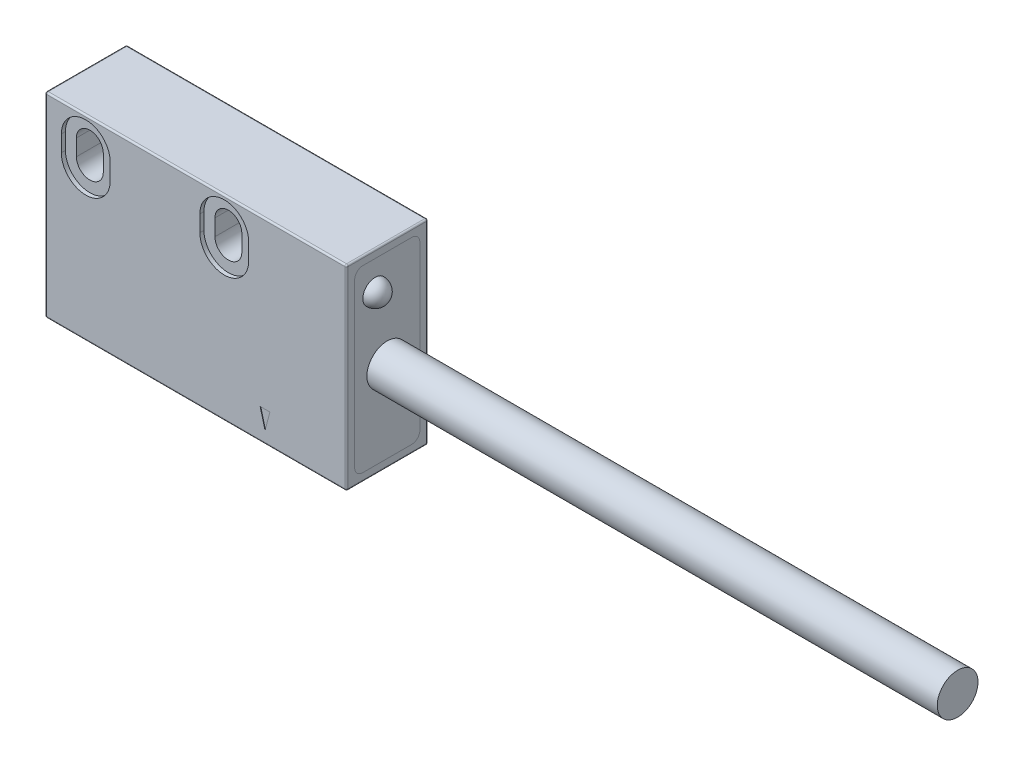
ISO-10303-21;
HEADER;
FILE_DESCRIPTION(('STEP AP214'),'2;1');
FILE_NAME('part.step','',(''),(''),'','','');
FILE_SCHEMA(('AUTOMOTIVE_DESIGN { 1 0 10303 214 1 1 1 1 }'));
ENDSEC;
DATA;
#1=APPLICATION_CONTEXT('core data for automotive mechanical design processes');
#2=APPLICATION_PROTOCOL_DEFINITION('international standard','automotive_design',2000,#1);
#3=PRODUCT_CONTEXT('',#1,'mechanical');
#4=PRODUCT('Part','Part','',(#3));
#5=PRODUCT_RELATED_PRODUCT_CATEGORY('part','',(#4));
#6=PRODUCT_DEFINITION_FORMATION('','',#4);
#7=PRODUCT_DEFINITION_CONTEXT('part definition',#1,'design');
#8=PRODUCT_DEFINITION('design','',#6,#7);
#9=PRODUCT_DEFINITION_SHAPE('','',#8);
#10=(LENGTH_UNIT() NAMED_UNIT(*) SI_UNIT(.MILLI.,.METRE.));
#11=(NAMED_UNIT(*) PLANE_ANGLE_UNIT() SI_UNIT($,.RADIAN.));
#12=(NAMED_UNIT(*) SI_UNIT($,.STERADIAN.) SOLID_ANGLE_UNIT());
#13=UNCERTAINTY_MEASURE_WITH_UNIT(LENGTH_MEASURE(1.E-05),#10,'distance_accuracy_value','');
#14=(GEOMETRIC_REPRESENTATION_CONTEXT(3) GLOBAL_UNCERTAINTY_ASSIGNED_CONTEXT((#13)) GLOBAL_UNIT_ASSIGNED_CONTEXT((#10,
#11,#12)) REPRESENTATION_CONTEXT('',''));
#15=CARTESIAN_POINT('',(0.,0.,0.));
#16=DIRECTION('',(0.,0.,1.));
#17=DIRECTION('',(1.,0.,0.));
#18=AXIS2_PLACEMENT_3D('',#15,#16,#17);
#19=CARTESIAN_POINT('',(92.8823529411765,-7.08403361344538,5.));
#20=DIRECTION('',(-1.,0.,0.));
#21=DIRECTION('',(0.,0.,1.));
#22=AXIS2_PLACEMENT_3D('',#19,#20,#21);
#23=CYLINDRICAL_SURFACE('',#22,2.5);
#24=CARTESIAN_POINT('',(92.8823529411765,-7.08403361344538,5.));
#25=DIRECTION('',(1.,0.,0.));
#26=DIRECTION('',(0.,0.,-1.));
#27=AXIS2_PLACEMENT_3D('',#24,#25,#26);
#28=CIRCLE('',#27,2.5);
#29=CARTESIAN_POINT('',(92.8823529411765,-7.08403361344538,2.5));
#30=VERTEX_POINT('',#29);
#31=EDGE_CURVE('E11',#30,#30,#28,.T.);
#32=ORIENTED_EDGE('',*,*,#31,.F.);
#33=EDGE_LOOP('',(#32));
#34=FACE_BOUND('',#33,.T.);
#35=CARTESIAN_POINT('',(22.8823529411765,-7.08403361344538,5.));
#36=DIRECTION('',(1.,0.,0.));
#37=DIRECTION('',(0.,0.,-1.));
#38=AXIS2_PLACEMENT_3D('',#35,#36,#37);
#39=CIRCLE('',#38,2.5);
#40=CARTESIAN_POINT('',(22.8823529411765,-7.08403361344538,2.5));
#41=VERTEX_POINT('',#40);
#42=EDGE_CURVE('E49',#41,#41,#39,.T.);
#43=ORIENTED_EDGE('',*,*,#42,.T.);
#44=EDGE_LOOP('',(#43));
#45=FACE_BOUND('',#44,.T.);
#46=ADVANCED_FACE('F46',(#34,#45),#23,.T.);
#47=CARTESIAN_POINT('',(92.8823529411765,-7.08403361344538,5.));
#48=DIRECTION('',(1.,0.,0.));
#49=DIRECTION('',(0.,0.,-1.));
#50=AXIS2_PLACEMENT_3D('',#47,#48,#49);
#51=PLANE('',#50);
#52=ORIENTED_EDGE('',*,*,#31,.T.);
#53=EDGE_LOOP('',(#52));
#54=FACE_BOUND('',#53,.T.);
#55=ADVANCED_FACE('F61',(#54),#51,.T.);
#56=CARTESIAN_POINT('',(22.8823529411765,-7.08403361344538,5.));
#57=DIRECTION('',(1.,0.,0.));
#58=DIRECTION('',(0.,0.,-1.));
#59=AXIS2_PLACEMENT_3D('',#56,#57,#58);
#60=PLANE('',#59);
#61=ORIENTED_EDGE('',*,*,#42,.F.);
#62=EDGE_LOOP('',(#61));
#63=FACE_BOUND('',#62,.T.);
#64=ADVANCED_FACE('F59',(#63),#60,.F.);
#65=CLOSED_SHELL('',(#46,#55,#64));
#66=MANIFOLD_SOLID_BREP('B2',#65);
#67=CARTESIAN_POINT('',(22.8823529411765,1.41596638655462,6.5));
#68=DIRECTION('',(0.,1.,0.));
#69=DIRECTION('',(0.,0.,-1.));
#70=AXIS2_PLACEMENT_3D('',#67,#68,#69);
#71=SPHERICAL_SURFACE('',#70,1.5);
#72=CARTESIAN_POINT('',(22.8823529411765,2.91596638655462,6.5));
#73=VERTEX_POINT('',#72);
#74=VERTEX_LOOP('',#73);
#75=FACE_BOUND('',#74,.T.);
#76=ADVANCED_FACE('F99',(#75),#71,.T.);
#77=CLOSED_SHELL('',(#76));
#78=MANIFOLD_SOLID_BREP('B6',#77);
#79=CARTESIAN_POINT('',(22.8823529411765,-16.0840336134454,1.99999999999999));
#80=DIRECTION('',(-1.,0.,0.));
#81=DIRECTION('',(0.,0.,1.));
#82=AXIS2_PLACEMENT_3D('',#79,#80,#81);
#83=CYLINDRICAL_SURFACE('',#82,1.);
#84=CARTESIAN_POINT('',(12.8823529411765,-16.0840336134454,1.99999999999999));
#85=DIRECTION('',(1.,0.,0.));
#86=DIRECTION('',(0.,0.,-1.));
#87=AXIS2_PLACEMENT_3D('',#84,#85,#86);
#88=CIRCLE('',#87,1.);
#89=CARTESIAN_POINT('',(12.8823529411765,-17.0840336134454,2.));
#90=VERTEX_POINT('',#89);
#91=CARTESIAN_POINT('',(12.8823529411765,-16.0840336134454,0.999999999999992));
#92=VERTEX_POINT('',#91);
#93=EDGE_CURVE('E219',#90,#92,#88,.T.);
#94=ORIENTED_EDGE('',*,*,#93,.T.);
#95=DIRECTION('',(-1.,0.,0.));
#96=VECTOR('',#95,1.);
#97=CARTESIAN_POINT('',(22.8823529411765,-16.0840336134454,0.999999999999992));
#98=LINE('',#97,#96);
#99=CARTESIAN_POINT('',(22.8823529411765,-16.0840336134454,0.999999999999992));
#100=VERTEX_POINT('',#99);
#101=EDGE_CURVE('E97',#100,#92,#98,.T.);
#102=ORIENTED_EDGE('',*,*,#101,.F.);
#103=CARTESIAN_POINT('',(22.8823529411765,-16.0840336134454,1.99999999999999));
#104=DIRECTION('',(1.,0.,0.));
#105=DIRECTION('',(0.,0.,-1.));
#106=AXIS2_PLACEMENT_3D('',#103,#104,#105);
#107=CIRCLE('',#106,1.);
#108=CARTESIAN_POINT('',(22.8823529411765,-17.0840336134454,2.));
#109=VERTEX_POINT('',#108);
#110=EDGE_CURVE('E233',#109,#100,#107,.T.);
#111=ORIENTED_EDGE('',*,*,#110,.F.);
#112=DIRECTION('',(-1.,0.,0.));
#113=VECTOR('',#112,1.);
#114=CARTESIAN_POINT('',(22.8823529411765,-17.0840336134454,2.));
#115=LINE('',#114,#113);
#116=EDGE_CURVE('E215',#109,#90,#115,.T.);
#117=ORIENTED_EDGE('',*,*,#116,.T.);
#118=EDGE_LOOP('',(#94,#102,#111,#117));
#119=FACE_BOUND('',#118,.T.);
#120=ADVANCED_FACE('F123',(#119),#83,.T.);
#121=CARTESIAN_POINT('',(22.8823529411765,3.91596638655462,0.999999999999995));
#122=DIRECTION('',(0.,0.,1.));
#123=DIRECTION('',(0.,-1.,0.));
#124=AXIS2_PLACEMENT_3D('',#121,#122,#123);
#125=PLANE('',#124);
#126=DIRECTION('',(0.,1.,0.));
#127=VECTOR('',#126,1.);
#128=CARTESIAN_POINT('',(12.8823529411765,3.91596638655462,0.999999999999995));
#129=LINE('',#128,#127);
#130=CARTESIAN_POINT('',(12.8823529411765,3.91596638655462,0.999999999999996));
#131=VERTEX_POINT('',#130);
#132=EDGE_CURVE('E222',#92,#131,#129,.T.);
#133=ORIENTED_EDGE('',*,*,#132,.T.);
#134=DIRECTION('',(-1.,0.,0.));
#135=VECTOR('',#134,1.);
#136=CARTESIAN_POINT('',(22.8823529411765,3.91596638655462,0.999999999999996));
#137=LINE('',#136,#135);
#138=CARTESIAN_POINT('',(22.8823529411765,3.91596638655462,0.999999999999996));
#139=VERTEX_POINT('',#138);
#140=EDGE_CURVE('E131',#139,#131,#137,.T.);
#141=ORIENTED_EDGE('',*,*,#140,.F.);
#142=DIRECTION('',(0.,1.,0.));
#143=VECTOR('',#142,1.);
#144=CARTESIAN_POINT('',(22.8823529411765,3.91596638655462,0.999999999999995));
#145=LINE('',#144,#143);
#146=EDGE_CURVE('E182',#100,#139,#145,.T.);
#147=ORIENTED_EDGE('',*,*,#146,.F.);
#148=ORIENTED_EDGE('',*,*,#101,.T.);
#149=EDGE_LOOP('',(#133,#141,#147,#148));
#150=FACE_BOUND('',#149,.T.);
#151=ADVANCED_FACE('F268',(#150),#125,.F.);
#152=CARTESIAN_POINT('',(22.8823529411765,3.91596638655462,2.));
#153=DIRECTION('',(-1.,0.,0.));
#154=DIRECTION('',(0.,0.,1.));
#155=AXIS2_PLACEMENT_3D('',#152,#153,#154);
#156=CYLINDRICAL_SURFACE('',#155,1.);
#157=CARTESIAN_POINT('',(12.8823529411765,3.91596638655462,2.));
#158=DIRECTION('',(1.,0.,0.));
#159=DIRECTION('',(0.,0.,1.));
#160=AXIS2_PLACEMENT_3D('',#157,#158,#159);
#161=CIRCLE('',#160,1.);
#162=CARTESIAN_POINT('',(12.8823529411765,4.91596638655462,2.));
#163=VERTEX_POINT('',#162);
#164=EDGE_CURVE('E224',#131,#163,#161,.T.);
#165=ORIENTED_EDGE('',*,*,#164,.T.);
#166=DIRECTION('',(-1.,0.,0.));
#167=VECTOR('',#166,1.);
#168=CARTESIAN_POINT('',(22.8823529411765,4.91596638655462,2.));
#169=LINE('',#168,#167);
#170=CARTESIAN_POINT('',(22.8823529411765,4.91596638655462,2.));
#171=VERTEX_POINT('',#170);
#172=EDGE_CURVE('E240',#171,#163,#169,.T.);
#173=ORIENTED_EDGE('',*,*,#172,.F.);
#174=CARTESIAN_POINT('',(22.8823529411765,3.91596638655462,2.));
#175=DIRECTION('',(1.,0.,0.));
#176=DIRECTION('',(0.,0.,1.));
#177=AXIS2_PLACEMENT_3D('',#174,#175,#176);
#178=CIRCLE('',#177,1.);
#179=EDGE_CURVE('E248',#139,#171,#178,.T.);
#180=ORIENTED_EDGE('',*,*,#179,.F.);
#181=ORIENTED_EDGE('',*,*,#140,.T.);
#182=EDGE_LOOP('',(#165,#173,#180,#181));
#183=FACE_BOUND('',#182,.T.);
#184=ADVANCED_FACE('F246',(#183),#156,.T.);
#185=CARTESIAN_POINT('',(22.8823529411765,4.91596638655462,7.99999999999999));
#186=DIRECTION('',(0.,-1.,0.));
#187=DIRECTION('',(0.,0.,-1.));
#188=AXIS2_PLACEMENT_3D('',#185,#186,#187);
#189=PLANE('',#188);
#190=DIRECTION('',(0.,0.,1.));
#191=VECTOR('',#190,1.);
#192=CARTESIAN_POINT('',(12.8823529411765,4.91596638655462,7.99999999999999));
#193=LINE('',#192,#191);
#194=CARTESIAN_POINT('',(12.8823529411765,4.91596638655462,7.99999999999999));
#195=VERTEX_POINT('',#194);
#196=EDGE_CURVE('E226',#163,#195,#193,.T.);
#197=ORIENTED_EDGE('',*,*,#196,.T.);
#198=DIRECTION('',(-1.,0.,0.));
#199=VECTOR('',#198,1.);
#200=CARTESIAN_POINT('',(22.8823529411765,4.91596638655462,7.99999999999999));
#201=LINE('',#200,#199);
#202=CARTESIAN_POINT('',(22.8823529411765,4.91596638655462,7.99999999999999));
#203=VERTEX_POINT('',#202);
#204=EDGE_CURVE('E237',#203,#195,#201,.T.);
#205=ORIENTED_EDGE('',*,*,#204,.F.);
#206=DIRECTION('',(0.,0.,1.));
#207=VECTOR('',#206,1.);
#208=CARTESIAN_POINT('',(22.8823529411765,4.91596638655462,7.99999999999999));
#209=LINE('',#208,#207);
#210=EDGE_CURVE('E260',#171,#203,#209,.T.);
#211=ORIENTED_EDGE('',*,*,#210,.F.);
#212=ORIENTED_EDGE('',*,*,#172,.T.);
#213=EDGE_LOOP('',(#197,#205,#211,#212));
#214=FACE_BOUND('',#213,.T.);
#215=ADVANCED_FACE('F256',(#214),#189,.F.);
#216=CARTESIAN_POINT('',(22.8823529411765,3.91596638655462,8.));
#217=DIRECTION('',(-1.,0.,0.));
#218=DIRECTION('',(0.,0.,1.));
#219=AXIS2_PLACEMENT_3D('',#216,#217,#218);
#220=CYLINDRICAL_SURFACE('',#219,1.);
#221=CARTESIAN_POINT('',(12.8823529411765,3.91596638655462,8.));
#222=DIRECTION('',(1.,0.,0.));
#223=DIRECTION('',(0.,0.,-1.));
#224=AXIS2_PLACEMENT_3D('',#221,#222,#223);
#225=CIRCLE('',#224,1.);
#226=CARTESIAN_POINT('',(12.8823529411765,3.91596638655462,9.));
#227=VERTEX_POINT('',#226);
#228=EDGE_CURVE('E228',#195,#227,#225,.T.);
#229=ORIENTED_EDGE('',*,*,#228,.T.);
#230=DIRECTION('',(-1.,0.,0.));
#231=VECTOR('',#230,1.);
#232=CARTESIAN_POINT('',(22.8823529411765,3.91596638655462,9.));
#233=LINE('',#232,#231);
#234=CARTESIAN_POINT('',(22.8823529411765,3.91596638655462,9.));
#235=VERTEX_POINT('',#234);
#236=EDGE_CURVE('E210',#235,#227,#233,.T.);
#237=ORIENTED_EDGE('',*,*,#236,.F.);
#238=CARTESIAN_POINT('',(22.8823529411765,3.91596638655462,8.));
#239=DIRECTION('',(1.,0.,0.));
#240=DIRECTION('',(0.,0.,-1.));
#241=AXIS2_PLACEMENT_3D('',#238,#239,#240);
#242=CIRCLE('',#241,1.);
#243=EDGE_CURVE('E201',#203,#235,#242,.T.);
#244=ORIENTED_EDGE('',*,*,#243,.F.);
#245=ORIENTED_EDGE('',*,*,#204,.T.);
#246=EDGE_LOOP('',(#229,#237,#244,#245));
#247=FACE_BOUND('',#246,.T.);
#248=ADVANCED_FACE('F259',(#247),#220,.T.);
#249=CARTESIAN_POINT('',(22.8823529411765,3.91596638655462,9.));
#250=DIRECTION('',(0.,0.,-1.));
#251=DIRECTION('',(0.,1.,0.));
#252=AXIS2_PLACEMENT_3D('',#249,#250,#251);
#253=PLANE('',#252);
#254=DIRECTION('',(0.,-1.,0.));
#255=VECTOR('',#254,1.);
#256=CARTESIAN_POINT('',(12.8823529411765,3.91596638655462,9.));
#257=LINE('',#256,#255);
#258=CARTESIAN_POINT('',(12.8823529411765,-16.0840336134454,9.));
#259=VERTEX_POINT('',#258);
#260=EDGE_CURVE('E209',#227,#259,#257,.T.);
#261=ORIENTED_EDGE('',*,*,#260,.T.);
#262=DIRECTION('',(-1.,0.,0.));
#263=VECTOR('',#262,1.);
#264=CARTESIAN_POINT('',(22.8823529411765,-16.0840336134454,9.));
#265=LINE('',#264,#263);
#266=CARTESIAN_POINT('',(22.8823529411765,-16.0840336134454,9.));
#267=VERTEX_POINT('',#266);
#268=EDGE_CURVE('E206',#267,#259,#265,.T.);
#269=ORIENTED_EDGE('',*,*,#268,.F.);
#270=DIRECTION('',(0.,-1.,0.));
#271=VECTOR('',#270,1.);
#272=CARTESIAN_POINT('',(22.8823529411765,3.91596638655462,9.));
#273=LINE('',#272,#271);
#274=EDGE_CURVE('E195',#235,#267,#273,.T.);
#275=ORIENTED_EDGE('',*,*,#274,.F.);
#276=ORIENTED_EDGE('',*,*,#236,.T.);
#277=EDGE_LOOP('',(#261,#269,#275,#276));
#278=FACE_BOUND('',#277,.T.);
#279=ADVANCED_FACE('F207',(#278),#253,.F.);
#280=CARTESIAN_POINT('',(22.8823529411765,-16.0840336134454,8.));
#281=DIRECTION('',(-1.,0.,0.));
#282=DIRECTION('',(0.,0.,1.));
#283=AXIS2_PLACEMENT_3D('',#280,#281,#282);
#284=CYLINDRICAL_SURFACE('',#283,1.);
#285=CARTESIAN_POINT('',(12.8823529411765,-16.0840336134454,8.));
#286=DIRECTION('',(1.,0.,0.));
#287=DIRECTION('',(0.,0.,-1.));
#288=AXIS2_PLACEMENT_3D('',#285,#286,#287);
#289=CIRCLE('',#288,1.);
#290=CARTESIAN_POINT('',(12.8823529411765,-17.0840336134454,7.99999999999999));
#291=VERTEX_POINT('',#290);
#292=EDGE_CURVE('E168',#259,#291,#289,.T.);
#293=ORIENTED_EDGE('',*,*,#292,.T.);
#294=DIRECTION('',(-1.,0.,0.));
#295=VECTOR('',#294,1.);
#296=CARTESIAN_POINT('',(22.8823529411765,-17.0840336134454,7.99999999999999));
#297=LINE('',#296,#295);
#298=CARTESIAN_POINT('',(22.8823529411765,-17.0840336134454,7.99999999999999));
#299=VERTEX_POINT('',#298);
#300=EDGE_CURVE('E211',#299,#291,#297,.T.);
#301=ORIENTED_EDGE('',*,*,#300,.F.);
#302=CARTESIAN_POINT('',(22.8823529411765,-16.0840336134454,8.));
#303=DIRECTION('',(1.,0.,0.));
#304=DIRECTION('',(0.,0.,-1.));
#305=AXIS2_PLACEMENT_3D('',#302,#303,#304);
#306=CIRCLE('',#305,1.);
#307=EDGE_CURVE('E199',#267,#299,#306,.T.);
#308=ORIENTED_EDGE('',*,*,#307,.F.);
#309=ORIENTED_EDGE('',*,*,#268,.T.);
#310=EDGE_LOOP('',(#293,#301,#308,#309));
#311=FACE_BOUND('',#310,.T.);
#312=ADVANCED_FACE('F213',(#311),#284,.T.);
#313=CARTESIAN_POINT('',(22.8823529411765,-17.0840336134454,7.99999999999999));
#314=DIRECTION('',(0.,1.,0.));
#315=DIRECTION('',(0.,0.,1.));
#316=AXIS2_PLACEMENT_3D('',#313,#314,#315);
#317=PLANE('',#316);
#318=DIRECTION('',(0.,0.,-1.));
#319=VECTOR('',#318,1.);
#320=CARTESIAN_POINT('',(12.8823529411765,-17.0840336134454,7.99999999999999));
#321=LINE('',#320,#319);
#322=EDGE_CURVE('E174',#291,#90,#321,.T.);
#323=ORIENTED_EDGE('',*,*,#322,.T.);
#324=ORIENTED_EDGE('',*,*,#116,.F.);
#325=DIRECTION('',(0.,0.,-1.));
#326=VECTOR('',#325,1.);
#327=CARTESIAN_POINT('',(22.8823529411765,-17.0840336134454,7.99999999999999));
#328=LINE('',#327,#326);
#329=EDGE_CURVE('E139',#299,#109,#328,.T.);
#330=ORIENTED_EDGE('',*,*,#329,.F.);
#331=ORIENTED_EDGE('',*,*,#300,.T.);
#332=EDGE_LOOP('',(#323,#324,#330,#331));
#333=FACE_BOUND('',#332,.T.);
#334=ADVANCED_FACE('F284',(#333),#317,.F.);
#335=CARTESIAN_POINT('',(22.8823529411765,-16.0840336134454,1.99999999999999));
#336=DIRECTION('',(1.,0.,0.));
#337=DIRECTION('',(0.,0.,-1.));
#338=AXIS2_PLACEMENT_3D('',#335,#336,#337);
#339=PLANE('',#338);
#340=ORIENTED_EDGE('',*,*,#110,.T.);
#341=ORIENTED_EDGE('',*,*,#146,.T.);
#342=ORIENTED_EDGE('',*,*,#179,.T.);
#343=ORIENTED_EDGE('',*,*,#210,.T.);
#344=ORIENTED_EDGE('',*,*,#243,.T.);
#345=ORIENTED_EDGE('',*,*,#274,.T.);
#346=ORIENTED_EDGE('',*,*,#307,.T.);
#347=ORIENTED_EDGE('',*,*,#329,.T.);
#348=EDGE_LOOP('',(#340,#341,#342,#343,#344,#345,#346,#347));
#349=FACE_BOUND('',#348,.T.);
#350=ADVANCED_FACE('F197',(#349),#339,.T.);
#351=CARTESIAN_POINT('',(12.8823529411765,-16.0840336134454,1.99999999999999));
#352=DIRECTION('',(1.,0.,0.));
#353=DIRECTION('',(0.,0.,-1.));
#354=AXIS2_PLACEMENT_3D('',#351,#352,#353);
#355=PLANE('',#354);
#356=ORIENTED_EDGE('',*,*,#93,.F.);
#357=ORIENTED_EDGE('',*,*,#322,.F.);
#358=ORIENTED_EDGE('',*,*,#292,.F.);
#359=ORIENTED_EDGE('',*,*,#260,.F.);
#360=ORIENTED_EDGE('',*,*,#228,.F.);
#361=ORIENTED_EDGE('',*,*,#196,.F.);
#362=ORIENTED_EDGE('',*,*,#164,.F.);
#363=ORIENTED_EDGE('',*,*,#132,.F.);
#364=EDGE_LOOP('',(#356,#357,#358,#359,#360,#361,#362,#363));
#365=FACE_BOUND('',#364,.T.);
#366=ADVANCED_FACE('F252',(#365),#355,.F.);
#367=CLOSED_SHELL('',(#120,#151,#184,#215,#248,#279,#312,#334,#350,#366));
#368=MANIFOLD_SOLID_BREP('B42',#367);
#369=CARTESIAN_POINT('',(0.,0.,10.));
#370=DIRECTION('',(0.,0.,1.));
#371=DIRECTION('',(1.,0.,0.));
#372=AXIS2_PLACEMENT_3D('',#369,#370,#371);
#373=PLANE('',#372);
#374=CARTESIAN_POINT('',(-9.11764705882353,2.41596638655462,10.));
#375=DIRECTION('',(0.,0.,1.));
#376=DIRECTION('',(1.,0.,0.));
#377=AXIS2_PLACEMENT_3D('',#374,#375,#376);
#378=CIRCLE('',#377,3.);
#379=CARTESIAN_POINT('',(-6.11764705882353,2.41596638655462,10.));
#380=VERTEX_POINT('',#379);
#381=CARTESIAN_POINT('',(-12.1176470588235,2.41596638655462,10.));
#382=VERTEX_POINT('',#381);
#383=EDGE_CURVE('E867',#380,#382,#378,.T.);
#384=ORIENTED_EDGE('',*,*,#383,.F.);
#385=DIRECTION('',(0.,1.,0.));
#386=VECTOR('',#385,1.);
#387=CARTESIAN_POINT('',(-6.11764705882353,2.41596638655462,10.));
#388=LINE('',#387,#386);
#389=CARTESIAN_POINT('',(-6.11764705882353,0.415966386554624,10.));
#390=VERTEX_POINT('',#389);
#391=EDGE_CURVE('E872',#390,#380,#388,.T.);
#392=ORIENTED_EDGE('',*,*,#391,.F.);
#393=CARTESIAN_POINT('',(-9.11764705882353,0.415966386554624,10.));
#394=DIRECTION('',(0.,0.,1.));
#395=DIRECTION('',(1.,0.,0.));
#396=AXIS2_PLACEMENT_3D('',#393,#394,#395);
#397=CIRCLE('',#396,3.);
#398=CARTESIAN_POINT('',(-12.1176470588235,0.415966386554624,10.));
#399=VERTEX_POINT('',#398);
#400=EDGE_CURVE('E886',#399,#390,#397,.T.);
#401=ORIENTED_EDGE('',*,*,#400,.F.);
#402=DIRECTION('',(0.,-1.,0.));
#403=VECTOR('',#402,1.);
#404=CARTESIAN_POINT('',(-12.1176470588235,2.41596638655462,10.));
#405=LINE('',#404,#403);
#406=EDGE_CURVE('E883',#382,#399,#405,.T.);
#407=ORIENTED_EDGE('',*,*,#406,.F.);
#408=EDGE_LOOP('',(#384,#392,#401,#407));
#409=FACE_BOUND('',#408,.T.);
#410=CARTESIAN_POINT('',(7.88235294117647,2.41596638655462,10.));
#411=DIRECTION('',(0.,0.,1.));
#412=DIRECTION('',(1.,0.,0.));
#413=AXIS2_PLACEMENT_3D('',#410,#411,#412);
#414=CIRCLE('',#413,3.);
#415=CARTESIAN_POINT('',(10.8823529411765,2.41596638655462,10.));
#416=VERTEX_POINT('',#415);
#417=CARTESIAN_POINT('',(4.88235294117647,2.41596638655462,10.));
#418=VERTEX_POINT('',#417);
#419=EDGE_CURVE('E826',#416,#418,#414,.T.);
#420=ORIENTED_EDGE('',*,*,#419,.F.);
#421=DIRECTION('',(0.,1.,0.));
#422=VECTOR('',#421,1.);
#423=CARTESIAN_POINT('',(10.8823529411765,2.41596638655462,10.));
#424=LINE('',#423,#422);
#425=CARTESIAN_POINT('',(10.8823529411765,0.415966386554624,10.));
#426=VERTEX_POINT('',#425);
#427=EDGE_CURVE('E831',#426,#416,#424,.T.);
#428=ORIENTED_EDGE('',*,*,#427,.F.);
#429=CARTESIAN_POINT('',(7.88235294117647,0.415966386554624,10.));
#430=DIRECTION('',(0.,0.,1.));
#431=DIRECTION('',(1.,0.,0.));
#432=AXIS2_PLACEMENT_3D('',#429,#430,#431);
#433=CIRCLE('',#432,3.);
#434=CARTESIAN_POINT('',(4.88235294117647,0.415966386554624,10.));
#435=VERTEX_POINT('',#434);
#436=EDGE_CURVE('E845',#435,#426,#433,.T.);
#437=ORIENTED_EDGE('',*,*,#436,.F.);
#438=DIRECTION('',(0.,-1.,0.));
#439=VECTOR('',#438,1.);
#440=CARTESIAN_POINT('',(4.88235294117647,2.41596638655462,10.));
#441=LINE('',#440,#439);
#442=EDGE_CURVE('E842',#418,#435,#441,.T.);
#443=ORIENTED_EDGE('',*,*,#442,.F.);
#444=EDGE_LOOP('',(#420,#428,#437,#443));
#445=FACE_BOUND('',#444,.T.);
#446=DIRECTION('',(0.,1.,0.));
#447=VECTOR('',#446,1.);
#448=CARTESIAN_POINT('',(22.6823529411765,5.91596638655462,10.));
#449=LINE('',#448,#447);
#450=CARTESIAN_POINT('',(22.6823529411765,-17.8840336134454,10.));
#451=VERTEX_POINT('',#450);
#452=CARTESIAN_POINT('',(22.6823529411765,5.71596638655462,10.));
#453=VERTEX_POINT('',#452);
#454=EDGE_CURVE('E973',#451,#453,#449,.T.);
#455=ORIENTED_EDGE('',*,*,#454,.T.);
#456=DIRECTION('',(-1.,0.,0.));
#457=VECTOR('',#456,1.);
#458=CARTESIAN_POINT('',(-14.1176470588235,5.71596638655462,10.));
#459=LINE('',#458,#457);
#460=CARTESIAN_POINT('',(-13.9176470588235,5.71596638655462,10.));
#461=VERTEX_POINT('',#460);
#462=EDGE_CURVE('E975',#453,#461,#459,.T.);
#463=ORIENTED_EDGE('',*,*,#462,.T.);
#464=DIRECTION('',(0.,-1.,0.));
#465=VECTOR('',#464,1.);
#466=CARTESIAN_POINT('',(-13.9176470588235,-18.0840336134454,10.));
#467=LINE('',#466,#465);
#468=CARTESIAN_POINT('',(-13.9176470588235,-17.8840336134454,10.));
#469=VERTEX_POINT('',#468);
#470=EDGE_CURVE('E968',#461,#469,#467,.T.);
#471=ORIENTED_EDGE('',*,*,#470,.T.);
#472=DIRECTION('',(1.,0.,0.));
#473=VECTOR('',#472,1.);
#474=CARTESIAN_POINT('',(22.8823529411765,-17.8840336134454,10.));
#475=LINE('',#474,#473);
#476=EDGE_CURVE('E970',#469,#451,#475,.T.);
#477=ORIENTED_EDGE('',*,*,#476,.T.);
#478=EDGE_LOOP('',(#455,#463,#471,#477));
#479=FACE_BOUND('',#478,.T.);
#480=DIRECTION('',(-0.258819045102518,0.965925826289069,0.));
#481=VECTOR('',#480,1.);
#482=CARTESIAN_POINT('',(12.8823529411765,-16.5840336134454,10.));
#483=LINE('',#482,#481);
#484=CARTESIAN_POINT('',(12.8823529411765,-16.5840336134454,10.));
#485=VERTEX_POINT('',#484);
#486=CARTESIAN_POINT('',(12.2823529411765,-14.344803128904,10.));
#487=VERTEX_POINT('',#486);
#488=EDGE_CURVE('E708',#485,#487,#483,.T.);
#489=ORIENTED_EDGE('',*,*,#488,.T.);
#490=DIRECTION('',(1.,0.,0.));
#491=VECTOR('',#490,1.);
#492=CARTESIAN_POINT('',(12.2823529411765,-14.344803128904,10.));
#493=LINE('',#492,#491);
#494=CARTESIAN_POINT('',(13.4823529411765,-14.344803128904,10.));
#495=VERTEX_POINT('',#494);
#496=EDGE_CURVE('E679',#487,#495,#493,.T.);
#497=ORIENTED_EDGE('',*,*,#496,.T.);
#498=DIRECTION('',(-0.258819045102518,-0.965925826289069,0.));
#499=VECTOR('',#498,1.);
#500=CARTESIAN_POINT('',(13.4823529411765,-14.344803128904,10.));
#501=LINE('',#500,#499);
#502=EDGE_CURVE('E715',#495,#485,#501,.T.);
#503=ORIENTED_EDGE('',*,*,#502,.T.);
#504=EDGE_LOOP('',(#489,#497,#503));
#505=FACE_BOUND('',#504,.T.);
#506=ADVANCED_FACE('F353',(#409,#445,#479,#505),#373,.T.);
#507=CARTESIAN_POINT('',(0.,0.,0.));
#508=DIRECTION('',(0.,0.,1.));
#509=DIRECTION('',(1.,0.,0.));
#510=AXIS2_PLACEMENT_3D('',#507,#508,#509);
#511=PLANE('',#510);
#512=DIRECTION('',(-0.258819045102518,-0.965925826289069,0.));
#513=VECTOR('',#512,1.);
#514=CARTESIAN_POINT('',(13.4823529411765,-14.344803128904,0.));
#515=LINE('',#514,#513);
#516=CARTESIAN_POINT('',(13.4823529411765,-14.344803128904,0.));
#517=VERTEX_POINT('',#516);
#518=CARTESIAN_POINT('',(12.8823529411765,-16.5840336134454,0.));
#519=VERTEX_POINT('',#518);
#520=EDGE_CURVE('E689',#517,#519,#515,.T.);
#521=ORIENTED_EDGE('',*,*,#520,.F.);
#522=DIRECTION('',(1.,0.,0.));
#523=VECTOR('',#522,1.);
#524=CARTESIAN_POINT('',(12.2823529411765,-14.344803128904,0.));
#525=LINE('',#524,#523);
#526=CARTESIAN_POINT('',(12.2823529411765,-14.344803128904,0.));
#527=VERTEX_POINT('',#526);
#528=EDGE_CURVE('E696',#527,#517,#525,.T.);
#529=ORIENTED_EDGE('',*,*,#528,.F.);
#530=DIRECTION('',(-0.258819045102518,0.965925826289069,0.));
#531=VECTOR('',#530,1.);
#532=CARTESIAN_POINT('',(12.8823529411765,-16.5840336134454,0.));
#533=LINE('',#532,#531);
#534=EDGE_CURVE('E676',#519,#527,#533,.T.);
#535=ORIENTED_EDGE('',*,*,#534,.F.);
#536=EDGE_LOOP('',(#521,#529,#535));
#537=FACE_BOUND('',#536,.T.);
#538=DIRECTION('',(0.,1.,0.));
#539=VECTOR('',#538,1.);
#540=CARTESIAN_POINT('',(22.6823529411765,0.,0.));
#541=LINE('',#540,#539);
#542=CARTESIAN_POINT('',(22.6823529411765,5.71596638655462,0.));
#543=VERTEX_POINT('',#542);
#544=CARTESIAN_POINT('',(22.6823529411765,-17.8840336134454,0.));
#545=VERTEX_POINT('',#544);
#546=EDGE_CURVE('E962',#543,#545,#541,.F.);
#547=ORIENTED_EDGE('',*,*,#546,.T.);
#548=DIRECTION('',(1.,0.,0.));
#549=VECTOR('',#548,1.);
#550=CARTESIAN_POINT('',(0.,-17.8840336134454,0.));
#551=LINE('',#550,#549);
#552=CARTESIAN_POINT('',(-13.9176470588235,-17.8840336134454,0.));
#553=VERTEX_POINT('',#552);
#554=EDGE_CURVE('E965',#545,#553,#551,.F.);
#555=ORIENTED_EDGE('',*,*,#554,.T.);
#556=DIRECTION('',(0.,-1.,0.));
#557=VECTOR('',#556,1.);
#558=CARTESIAN_POINT('',(-13.9176470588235,0.,0.));
#559=LINE('',#558,#557);
#560=CARTESIAN_POINT('',(-13.9176470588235,5.71596638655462,0.));
#561=VERTEX_POINT('',#560);
#562=EDGE_CURVE('E958',#553,#561,#559,.F.);
#563=ORIENTED_EDGE('',*,*,#562,.T.);
#564=DIRECTION('',(-1.,0.,0.));
#565=VECTOR('',#564,1.);
#566=CARTESIAN_POINT('',(0.,5.71596638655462,0.));
#567=LINE('',#566,#565);
#568=EDGE_CURVE('E960',#561,#543,#567,.F.);
#569=ORIENTED_EDGE('',*,*,#568,.T.);
#570=EDGE_LOOP('',(#547,#555,#563,#569));
#571=FACE_BOUND('',#570,.T.);
#572=CARTESIAN_POINT('',(-9.11764705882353,2.41596638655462,0.));
#573=DIRECTION('',(0.,0.,1.));
#574=DIRECTION('',(1.,0.,0.));
#575=AXIS2_PLACEMENT_3D('',#572,#573,#574);
#576=CIRCLE('',#575,3.);
#577=CARTESIAN_POINT('',(-6.11764705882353,2.41596638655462,0.));
#578=VERTEX_POINT('',#577);
#579=CARTESIAN_POINT('',(-12.1176470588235,2.41596638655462,0.));
#580=VERTEX_POINT('',#579);
#581=EDGE_CURVE('E789',#578,#580,#576,.T.);
#582=ORIENTED_EDGE('',*,*,#581,.T.);
#583=DIRECTION('',(0.,-1.,0.));
#584=VECTOR('',#583,1.);
#585=CARTESIAN_POINT('',(-12.1176470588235,2.41596638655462,0.));
#586=LINE('',#585,#584);
#587=CARTESIAN_POINT('',(-12.1176470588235,0.415966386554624,0.));
#588=VERTEX_POINT('',#587);
#589=EDGE_CURVE('E794',#580,#588,#586,.T.);
#590=ORIENTED_EDGE('',*,*,#589,.T.);
#591=CARTESIAN_POINT('',(-9.11764705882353,0.415966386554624,0.));
#592=DIRECTION('',(0.,0.,1.));
#593=DIRECTION('',(1.,0.,0.));
#594=AXIS2_PLACEMENT_3D('',#591,#592,#593);
#595=CIRCLE('',#594,3.);
#596=CARTESIAN_POINT('',(-6.11764705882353,0.415966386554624,0.));
#597=VERTEX_POINT('',#596);
#598=EDGE_CURVE('E806',#588,#597,#595,.T.);
#599=ORIENTED_EDGE('',*,*,#598,.T.);
#600=DIRECTION('',(0.,1.,0.));
#601=VECTOR('',#600,1.);
#602=CARTESIAN_POINT('',(-6.11764705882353,2.41596638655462,0.));
#603=LINE('',#602,#601);
#604=EDGE_CURVE('E803',#597,#578,#603,.T.);
#605=ORIENTED_EDGE('',*,*,#604,.T.);
#606=EDGE_LOOP('',(#582,#590,#599,#605));
#607=FACE_BOUND('',#606,.T.);
#608=CARTESIAN_POINT('',(7.88235294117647,2.41596638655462,0.));
#609=DIRECTION('',(0.,0.,1.));
#610=DIRECTION('',(1.,0.,0.));
#611=AXIS2_PLACEMENT_3D('',#608,#609,#610);
#612=CIRCLE('',#611,3.);
#613=CARTESIAN_POINT('',(10.8823529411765,2.41596638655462,0.));
#614=VERTEX_POINT('',#613);
#615=CARTESIAN_POINT('',(4.88235294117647,2.41596638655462,0.));
#616=VERTEX_POINT('',#615);
#617=EDGE_CURVE('E741',#614,#616,#612,.T.);
#618=ORIENTED_EDGE('',*,*,#617,.T.);
#619=DIRECTION('',(0.,-1.,0.));
#620=VECTOR('',#619,1.);
#621=CARTESIAN_POINT('',(4.88235294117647,2.41596638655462,0.));
#622=LINE('',#621,#620);
#623=CARTESIAN_POINT('',(4.88235294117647,0.415966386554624,0.));
#624=VERTEX_POINT('',#623);
#625=EDGE_CURVE('E757',#616,#624,#622,.T.);
#626=ORIENTED_EDGE('',*,*,#625,.T.);
#627=CARTESIAN_POINT('',(7.88235294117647,0.415966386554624,0.));
#628=DIRECTION('',(0.,0.,1.));
#629=DIRECTION('',(1.,0.,0.));
#630=AXIS2_PLACEMENT_3D('',#627,#628,#629);
#631=CIRCLE('',#630,3.);
#632=CARTESIAN_POINT('',(10.8823529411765,0.415966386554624,0.));
#633=VERTEX_POINT('',#632);
#634=EDGE_CURVE('E769',#624,#633,#631,.T.);
#635=ORIENTED_EDGE('',*,*,#634,.T.);
#636=DIRECTION('',(0.,1.,0.));
#637=VECTOR('',#636,1.);
#638=CARTESIAN_POINT('',(10.8823529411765,2.41596638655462,0.));
#639=LINE('',#638,#637);
#640=EDGE_CURVE('E766',#633,#614,#639,.T.);
#641=ORIENTED_EDGE('',*,*,#640,.T.);
#642=EDGE_LOOP('',(#618,#626,#635,#641));
#643=FACE_BOUND('',#642,.T.);
#644=ADVANCED_FACE('F1122',(#537,#571,#607,#643),#511,.F.);
#645=CARTESIAN_POINT('',(7.88235294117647,2.41596638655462,0.));
#646=DIRECTION('',(0.,0.,1.));
#647=DIRECTION('',(1.,0.,0.));
#648=AXIS2_PLACEMENT_3D('',#645,#646,#647);
#649=CYLINDRICAL_SURFACE('',#648,1.65);
#650=CARTESIAN_POINT('',(7.88235294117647,2.41596638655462,0.5));
#651=DIRECTION('',(0.,0.,-1.));
#652=DIRECTION('',(-1.,0.,0.));
#653=AXIS2_PLACEMENT_3D('',#650,#651,#652);
#654=CIRCLE('',#653,1.65);
#655=CARTESIAN_POINT('',(9.53235294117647,2.41596638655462,0.5));
#656=VERTEX_POINT('',#655);
#657=CARTESIAN_POINT('',(6.23235294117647,2.41596638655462,0.5));
#658=VERTEX_POINT('',#657);
#659=EDGE_CURVE('E787',#656,#658,#654,.F.);
#660=ORIENTED_EDGE('',*,*,#659,.F.);
#661=DIRECTION('',(0.,0.,1.));
#662=VECTOR('',#661,1.);
#663=CARTESIAN_POINT('',(9.53235294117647,2.41596638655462,0.));
#664=LINE('',#663,#662);
#665=CARTESIAN_POINT('',(9.53235294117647,2.41596638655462,9.5));
#666=VERTEX_POINT('',#665);
#667=EDGE_CURVE('E909',#656,#666,#664,.T.);
#668=ORIENTED_EDGE('',*,*,#667,.T.);
#669=CARTESIAN_POINT('',(7.88235294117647,2.41596638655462,9.5));
#670=DIRECTION('',(0.,0.,1.));
#671=DIRECTION('',(1.,0.,0.));
#672=AXIS2_PLACEMENT_3D('',#669,#670,#671);
#673=CIRCLE('',#672,1.65);
#674=CARTESIAN_POINT('',(6.23235294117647,2.41596638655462,9.5));
#675=VERTEX_POINT('',#674);
#676=EDGE_CURVE('E864',#675,#666,#673,.F.);
#677=ORIENTED_EDGE('',*,*,#676,.F.);
#678=DIRECTION('',(0.,0.,1.));
#679=VECTOR('',#678,1.);
#680=CARTESIAN_POINT('',(6.23235294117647,2.41596638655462,0.));
#681=LINE('',#680,#679);
#682=EDGE_CURVE('E908',#658,#675,#681,.T.);
#683=ORIENTED_EDGE('',*,*,#682,.F.);
#684=EDGE_LOOP('',(#660,#668,#677,#683));
#685=FACE_BOUND('',#684,.T.);
#686=ADVANCED_FACE('F1128',(#685),#649,.F.);
#687=CARTESIAN_POINT('',(9.53235294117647,2.41596638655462,0.));
#688=DIRECTION('',(1.,0.,0.));
#689=DIRECTION('',(0.,0.,-1.));
#690=AXIS2_PLACEMENT_3D('',#687,#688,#689);
#691=PLANE('',#690);
#692=DIRECTION('',(0.,1.,0.));
#693=VECTOR('',#692,1.);
#694=CARTESIAN_POINT('',(9.53235294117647,2.41596638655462,0.5));
#695=LINE('',#694,#693);
#696=CARTESIAN_POINT('',(9.53235294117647,0.415966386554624,0.5));
#697=VERTEX_POINT('',#696);
#698=EDGE_CURVE('E785',#697,#656,#695,.T.);
#699=ORIENTED_EDGE('',*,*,#698,.F.);
#700=DIRECTION('',(0.,0.,1.));
#701=VECTOR('',#700,1.);
#702=CARTESIAN_POINT('',(9.53235294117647,0.415966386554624,0.));
#703=LINE('',#702,#701);
#704=CARTESIAN_POINT('',(9.53235294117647,0.415966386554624,9.5));
#705=VERTEX_POINT('',#704);
#706=EDGE_CURVE('E912',#697,#705,#703,.T.);
#707=ORIENTED_EDGE('',*,*,#706,.T.);
#708=DIRECTION('',(0.,-1.,0.));
#709=VECTOR('',#708,1.);
#710=CARTESIAN_POINT('',(9.53235294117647,2.41596638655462,9.5));
#711=LINE('',#710,#709);
#712=EDGE_CURVE('E861',#666,#705,#711,.T.);
#713=ORIENTED_EDGE('',*,*,#712,.F.);
#714=ORIENTED_EDGE('',*,*,#667,.F.);
#715=EDGE_LOOP('',(#699,#707,#713,#714));
#716=FACE_BOUND('',#715,.T.);
#717=ADVANCED_FACE('F1573',(#716),#691,.F.);
#718=CARTESIAN_POINT('',(7.88235294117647,0.415966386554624,0.));
#719=DIRECTION('',(0.,0.,1.));
#720=DIRECTION('',(1.,0.,0.));
#721=AXIS2_PLACEMENT_3D('',#718,#719,#720);
#722=CYLINDRICAL_SURFACE('',#721,1.65);
#723=CARTESIAN_POINT('',(7.88235294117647,0.415966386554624,0.5));
#724=DIRECTION('',(0.,0.,-1.));
#725=DIRECTION('',(-1.,0.,0.));
#726=AXIS2_PLACEMENT_3D('',#723,#724,#725);
#727=CIRCLE('',#726,1.65);
#728=CARTESIAN_POINT('',(6.23235294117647,0.415966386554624,0.5));
#729=VERTEX_POINT('',#728);
#730=EDGE_CURVE('E777',#729,#697,#727,.F.);
#731=ORIENTED_EDGE('',*,*,#730,.F.);
#732=DIRECTION('',(0.,0.,1.));
#733=VECTOR('',#732,1.);
#734=CARTESIAN_POINT('',(6.23235294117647,0.415966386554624,0.));
#735=LINE('',#734,#733);
#736=CARTESIAN_POINT('',(6.23235294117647,0.415966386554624,9.5));
#737=VERTEX_POINT('',#736);
#738=EDGE_CURVE('E914',#729,#737,#735,.T.);
#739=ORIENTED_EDGE('',*,*,#738,.T.);
#740=CARTESIAN_POINT('',(7.88235294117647,0.415966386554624,9.5));
#741=DIRECTION('',(0.,0.,1.));
#742=DIRECTION('',(1.,0.,0.));
#743=AXIS2_PLACEMENT_3D('',#740,#741,#742);
#744=CIRCLE('',#743,1.65);
#745=EDGE_CURVE('E852',#705,#737,#744,.F.);
#746=ORIENTED_EDGE('',*,*,#745,.F.);
#747=ORIENTED_EDGE('',*,*,#706,.F.);
#748=EDGE_LOOP('',(#731,#739,#746,#747));
#749=FACE_BOUND('',#748,.T.);
#750=ADVANCED_FACE('F1583',(#749),#722,.F.);
#751=CARTESIAN_POINT('',(6.23235294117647,2.41596638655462,0.));
#752=DIRECTION('',(-1.,0.,0.));
#753=DIRECTION('',(0.,0.,1.));
#754=AXIS2_PLACEMENT_3D('',#751,#752,#753);
#755=PLANE('',#754);
#756=DIRECTION('',(0.,-1.,0.));
#757=VECTOR('',#756,1.);
#758=CARTESIAN_POINT('',(6.23235294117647,2.41596638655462,0.5));
#759=LINE('',#758,#757);
#760=EDGE_CURVE('E932',#658,#729,#759,.T.);
#761=ORIENTED_EDGE('',*,*,#760,.F.);
#762=ORIENTED_EDGE('',*,*,#682,.T.);
#763=DIRECTION('',(0.,1.,0.));
#764=VECTOR('',#763,1.);
#765=CARTESIAN_POINT('',(6.23235294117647,2.41596638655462,9.5));
#766=LINE('',#765,#764);
#767=EDGE_CURVE('E927',#737,#675,#766,.T.);
#768=ORIENTED_EDGE('',*,*,#767,.F.);
#769=ORIENTED_EDGE('',*,*,#738,.F.);
#770=EDGE_LOOP('',(#761,#762,#768,#769));
#771=FACE_BOUND('',#770,.T.);
#772=ADVANCED_FACE('F1592',(#771),#755,.F.);
#773=CARTESIAN_POINT('',(-9.11764705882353,2.41596638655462,0.));
#774=DIRECTION('',(0.,0.,1.));
#775=DIRECTION('',(1.,0.,0.));
#776=AXIS2_PLACEMENT_3D('',#773,#774,#775);
#777=CYLINDRICAL_SURFACE('',#776,1.65);
#778=CARTESIAN_POINT('',(-9.11764705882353,2.41596638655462,0.5));
#779=DIRECTION('',(0.,0.,-1.));
#780=DIRECTION('',(-1.,0.,0.));
#781=AXIS2_PLACEMENT_3D('',#778,#779,#780);
#782=CIRCLE('',#781,1.65);
#783=CARTESIAN_POINT('',(-7.46764705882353,2.41596638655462,0.5));
#784=VERTEX_POINT('',#783);
#785=CARTESIAN_POINT('',(-10.7676470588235,2.41596638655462,0.5));
#786=VERTEX_POINT('',#785);
#787=EDGE_CURVE('E824',#784,#786,#782,.F.);
#788=ORIENTED_EDGE('',*,*,#787,.F.);
#789=DIRECTION('',(0.,0.,1.));
#790=VECTOR('',#789,1.);
#791=CARTESIAN_POINT('',(-7.46764705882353,2.41596638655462,0.));
#792=LINE('',#791,#790);
#793=CARTESIAN_POINT('',(-7.46764705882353,2.41596638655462,9.5));
#794=VERTEX_POINT('',#793);
#795=EDGE_CURVE('E917',#784,#794,#792,.T.);
#796=ORIENTED_EDGE('',*,*,#795,.T.);
#797=CARTESIAN_POINT('',(-9.11764705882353,2.41596638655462,9.5));
#798=DIRECTION('',(0.,0.,1.));
#799=DIRECTION('',(1.,0.,0.));
#800=AXIS2_PLACEMENT_3D('',#797,#798,#799);
#801=CIRCLE('',#800,1.65);
#802=CARTESIAN_POINT('',(-10.7676470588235,2.41596638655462,9.5));
#803=VERTEX_POINT('',#802);
#804=EDGE_CURVE('E905',#803,#794,#801,.F.);
#805=ORIENTED_EDGE('',*,*,#804,.F.);
#806=DIRECTION('',(0.,0.,1.));
#807=VECTOR('',#806,1.);
#808=CARTESIAN_POINT('',(-10.7676470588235,2.41596638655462,0.));
#809=LINE('',#808,#807);
#810=EDGE_CURVE('E911',#786,#803,#809,.T.);
#811=ORIENTED_EDGE('',*,*,#810,.F.);
#812=EDGE_LOOP('',(#788,#796,#805,#811));
#813=FACE_BOUND('',#812,.T.);
#814=ADVANCED_FACE('F1134',(#813),#777,.F.);
#815=CARTESIAN_POINT('',(-7.46764705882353,2.41596638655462,0.));
#816=DIRECTION('',(1.,0.,0.));
#817=DIRECTION('',(0.,1.,0.));
#818=AXIS2_PLACEMENT_3D('',#815,#816,#817);
#819=PLANE('',#818);
#820=DIRECTION('',(0.,1.,0.));
#821=VECTOR('',#820,1.);
#822=CARTESIAN_POINT('',(-7.46764705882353,2.41596638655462,0.5));
#823=LINE('',#822,#821);
#824=CARTESIAN_POINT('',(-7.46764705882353,0.415966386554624,0.5));
#825=VERTEX_POINT('',#824);
#826=EDGE_CURVE('E822',#825,#784,#823,.T.);
#827=ORIENTED_EDGE('',*,*,#826,.F.);
#828=DIRECTION('',(0.,0.,1.));
#829=VECTOR('',#828,1.);
#830=CARTESIAN_POINT('',(-7.46764705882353,0.415966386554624,0.));
#831=LINE('',#830,#829);
#832=CARTESIAN_POINT('',(-7.46764705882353,0.415966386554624,9.5));
#833=VERTEX_POINT('',#832);
#834=EDGE_CURVE('E920',#825,#833,#831,.T.);
#835=ORIENTED_EDGE('',*,*,#834,.T.);
#836=DIRECTION('',(0.,-1.,0.));
#837=VECTOR('',#836,1.);
#838=CARTESIAN_POINT('',(-7.46764705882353,2.41596638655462,9.5));
#839=LINE('',#838,#837);
#840=EDGE_CURVE('E902',#794,#833,#839,.T.);
#841=ORIENTED_EDGE('',*,*,#840,.F.);
#842=ORIENTED_EDGE('',*,*,#795,.F.);
#843=EDGE_LOOP('',(#827,#835,#841,#842));
#844=FACE_BOUND('',#843,.T.);
#845=ADVANCED_FACE('F1609',(#844),#819,.F.);
#846=CARTESIAN_POINT('',(-9.11764705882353,0.415966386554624,0.));
#847=DIRECTION('',(0.,0.,1.));
#848=DIRECTION('',(1.,0.,0.));
#849=AXIS2_PLACEMENT_3D('',#846,#847,#848);
#850=CYLINDRICAL_SURFACE('',#849,1.65);
#851=CARTESIAN_POINT('',(-9.11764705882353,0.415966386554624,0.5));
#852=DIRECTION('',(0.,0.,-1.));
#853=DIRECTION('',(-1.,0.,0.));
#854=AXIS2_PLACEMENT_3D('',#851,#852,#853);
#855=CIRCLE('',#854,1.65);
#856=CARTESIAN_POINT('',(-10.7676470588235,0.415966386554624,0.5));
#857=VERTEX_POINT('',#856);
#858=EDGE_CURVE('E814',#857,#825,#855,.F.);
#859=ORIENTED_EDGE('',*,*,#858,.F.);
#860=DIRECTION('',(0.,0.,1.));
#861=VECTOR('',#860,1.);
#862=CARTESIAN_POINT('',(-10.7676470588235,0.415966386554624,0.));
#863=LINE('',#862,#861);
#864=CARTESIAN_POINT('',(-10.7676470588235,0.415966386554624,9.5));
#865=VERTEX_POINT('',#864);
#866=EDGE_CURVE('E922',#857,#865,#863,.T.);
#867=ORIENTED_EDGE('',*,*,#866,.T.);
#868=CARTESIAN_POINT('',(-9.11764705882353,0.415966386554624,9.5));
#869=DIRECTION('',(0.,0.,1.));
#870=DIRECTION('',(1.,0.,0.));
#871=AXIS2_PLACEMENT_3D('',#868,#869,#870);
#872=CIRCLE('',#871,1.65);
#873=EDGE_CURVE('E893',#833,#865,#872,.F.);
#874=ORIENTED_EDGE('',*,*,#873,.F.);
#875=ORIENTED_EDGE('',*,*,#834,.F.);
#876=EDGE_LOOP('',(#859,#867,#874,#875));
#877=FACE_BOUND('',#876,.T.);
#878=ADVANCED_FACE('F1617',(#877),#850,.F.);
#879=CARTESIAN_POINT('',(-10.7676470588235,2.41596638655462,0.));
#880=DIRECTION('',(-1.,0.,0.));
#881=DIRECTION('',(0.,0.,1.));
#882=AXIS2_PLACEMENT_3D('',#879,#880,#881);
#883=PLANE('',#882);
#884=DIRECTION('',(0.,-1.,0.));
#885=VECTOR('',#884,1.);
#886=CARTESIAN_POINT('',(-10.7676470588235,2.41596638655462,0.5));
#887=LINE('',#886,#885);
#888=EDGE_CURVE('E930',#786,#857,#887,.T.);
#889=ORIENTED_EDGE('',*,*,#888,.F.);
#890=ORIENTED_EDGE('',*,*,#810,.T.);
#891=DIRECTION('',(0.,1.,0.));
#892=VECTOR('',#891,1.);
#893=CARTESIAN_POINT('',(-10.7676470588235,2.41596638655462,9.5));
#894=LINE('',#893,#892);
#895=EDGE_CURVE('E919',#865,#803,#894,.T.);
#896=ORIENTED_EDGE('',*,*,#895,.F.);
#897=ORIENTED_EDGE('',*,*,#866,.F.);
#898=EDGE_LOOP('',(#889,#890,#896,#897));
#899=FACE_BOUND('',#898,.T.);
#900=ADVANCED_FACE('F1151',(#899),#883,.F.);
#901=CARTESIAN_POINT('',(-14.1176470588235,5.91596638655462,10.));
#902=DIRECTION('',(1.,0.,0.));
#903=DIRECTION('',(0.,1.,0.));
#904=AXIS2_PLACEMENT_3D('',#901,#902,#903);
#905=PLANE('',#904);
#906=DIRECTION('',(0.,-1.,0.));
#907=VECTOR('',#906,1.);
#908=CARTESIAN_POINT('',(-14.1176470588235,5.91596638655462,9.8));
#909=LINE('',#908,#907);
#910=CARTESIAN_POINT('',(-14.1176470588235,-17.8840336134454,9.8));
#911=VERTEX_POINT('',#910);
#912=CARTESIAN_POINT('',(-14.1176470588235,5.71596638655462,9.8));
#913=VERTEX_POINT('',#912);
#914=EDGE_CURVE('E982',#911,#913,#909,.F.);
#915=ORIENTED_EDGE('',*,*,#914,.T.);
#916=DIRECTION('',(0.,0.,-1.));
#917=VECTOR('',#916,1.);
#918=CARTESIAN_POINT('',(-14.1176470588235,5.71596638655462,10.));
#919=LINE('',#918,#917);
#920=CARTESIAN_POINT('',(-14.1176470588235,5.71596638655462,0.200000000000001));
#921=VERTEX_POINT('',#920);
#922=EDGE_CURVE('E984',#913,#921,#919,.T.);
#923=ORIENTED_EDGE('',*,*,#922,.T.);
#924=DIRECTION('',(0.,-1.,0.));
#925=VECTOR('',#924,1.);
#926=CARTESIAN_POINT('',(-14.1176470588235,5.91596638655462,0.200000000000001));
#927=LINE('',#926,#925);
#928=CARTESIAN_POINT('',(-14.1176470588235,-17.8840336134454,0.200000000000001));
#929=VERTEX_POINT('',#928);
#930=EDGE_CURVE('E978',#921,#929,#927,.T.);
#931=ORIENTED_EDGE('',*,*,#930,.T.);
#932=DIRECTION('',(0.,0.,-1.));
#933=VECTOR('',#932,1.);
#934=CARTESIAN_POINT('',(-14.1176470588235,-17.8840336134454,10.));
#935=LINE('',#934,#933);
#936=EDGE_CURVE('E980',#929,#911,#935,.F.);
#937=ORIENTED_EDGE('',*,*,#936,.T.);
#938=EDGE_LOOP('',(#915,#923,#931,#937));
#939=FACE_BOUND('',#938,.T.);
#940=ADVANCED_FACE('F1147',(#939),#905,.F.);
#941=CARTESIAN_POINT('',(-14.1176470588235,-18.0840336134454,10.));
#942=DIRECTION('',(0.,1.,0.));
#943=DIRECTION('',(0.,0.,1.));
#944=AXIS2_PLACEMENT_3D('',#941,#942,#943);
#945=PLANE('',#944);
#946=DIRECTION('',(1.,0.,0.));
#947=VECTOR('',#946,1.);
#948=CARTESIAN_POINT('',(-14.1176470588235,-18.0840336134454,0.200000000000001));
#949=LINE('',#948,#947);
#950=CARTESIAN_POINT('',(-13.9176470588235,-18.0840336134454,0.200000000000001));
#951=VERTEX_POINT('',#950);
#952=CARTESIAN_POINT('',(22.6823529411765,-18.0840336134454,0.200000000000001));
#953=VERTEX_POINT('',#952);
#954=EDGE_CURVE('E955',#951,#953,#949,.T.);
#955=ORIENTED_EDGE('',*,*,#954,.T.);
#956=DIRECTION('',(0.,0.,-1.));
#957=VECTOR('',#956,1.);
#958=CARTESIAN_POINT('',(22.6823529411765,-18.0840336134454,10.));
#959=LINE('',#958,#957);
#960=CARTESIAN_POINT('',(22.6823529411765,-18.0840336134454,9.8));
#961=VERTEX_POINT('',#960);
#962=EDGE_CURVE('E1045',#953,#961,#959,.F.);
#963=ORIENTED_EDGE('',*,*,#962,.T.);
#964=DIRECTION('',(1.,0.,0.));
#965=VECTOR('',#964,1.);
#966=CARTESIAN_POINT('',(-14.1176470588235,-18.0840336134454,9.8));
#967=LINE('',#966,#965);
#968=CARTESIAN_POINT('',(-13.9176470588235,-18.0840336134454,9.8));
#969=VERTEX_POINT('',#968);
#970=EDGE_CURVE('E953',#961,#969,#967,.F.);
#971=ORIENTED_EDGE('',*,*,#970,.T.);
#972=DIRECTION('',(0.,0.,-1.));
#973=VECTOR('',#972,1.);
#974=CARTESIAN_POINT('',(-13.9176470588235,-18.0840336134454,10.));
#975=LINE('',#974,#973);
#976=EDGE_CURVE('E951',#969,#951,#975,.T.);
#977=ORIENTED_EDGE('',*,*,#976,.T.);
#978=EDGE_LOOP('',(#955,#963,#971,#977));
#979=FACE_BOUND('',#978,.T.);
#980=ADVANCED_FACE('F1144',(#979),#945,.F.);
#981=CARTESIAN_POINT('',(22.8823529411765,5.91596638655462,10.));
#982=DIRECTION('',(-1.,0.,0.));
#983=DIRECTION('',(0.,0.,1.));
#984=AXIS2_PLACEMENT_3D('',#981,#982,#983);
#985=PLANE('',#984);
#986=DIRECTION('',(0.,0.,-1.));
#987=VECTOR('',#986,1.);
#988=CARTESIAN_POINT('',(22.8823529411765,-17.0840336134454,9.));
#989=LINE('',#988,#987);
#990=CARTESIAN_POINT('',(22.8823529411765,-17.0840336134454,8.));
#991=VERTEX_POINT('',#990);
#992=CARTESIAN_POINT('',(22.8823529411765,-17.0840336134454,2.));
#993=VERTEX_POINT('',#992);
#994=EDGE_CURVE('E745',#991,#993,#989,.T.);
#995=ORIENTED_EDGE('',*,*,#994,.F.);
#996=CARTESIAN_POINT('',(22.8823529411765,-16.0840336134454,8.));
#997=DIRECTION('',(-1.,0.,0.));
#998=DIRECTION('',(0.,0.,1.));
#999=AXIS2_PLACEMENT_3D('',#996,#997,#998);
#1000=CIRCLE('',#999,1.);
#1001=CARTESIAN_POINT('',(22.8823529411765,-16.0840336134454,9.));
#1002=VERTEX_POINT('',#1001);
#1003=EDGE_CURVE('E1080',#991,#1002,#1000,.T.);
#1004=ORIENTED_EDGE('',*,*,#1003,.T.);
#1005=DIRECTION('',(0.,-1.,0.));
#1006=VECTOR('',#1005,1.);
#1007=CARTESIAN_POINT('',(22.8823529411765,4.91596638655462,9.));
#1008=LINE('',#1007,#1006);
#1009=CARTESIAN_POINT('',(22.8823529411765,3.91596638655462,9.));
#1010=VERTEX_POINT('',#1009);
#1011=EDGE_CURVE('E742',#1010,#1002,#1008,.T.);
#1012=ORIENTED_EDGE('',*,*,#1011,.F.);
#1013=CARTESIAN_POINT('',(22.8823529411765,3.91596638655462,8.));
#1014=DIRECTION('',(-1.,0.,0.));
#1015=DIRECTION('',(0.,0.,1.));
#1016=AXIS2_PLACEMENT_3D('',#1013,#1014,#1015);
#1017=CIRCLE('',#1016,1.);
#1018=CARTESIAN_POINT('',(22.8823529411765,4.91596638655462,8.));
#1019=VERTEX_POINT('',#1018);
#1020=EDGE_CURVE('E361',#1010,#1019,#1017,.T.);
#1021=ORIENTED_EDGE('',*,*,#1020,.T.);
#1022=DIRECTION('',(0.,0.,1.));
#1023=VECTOR('',#1022,1.);
#1024=CARTESIAN_POINT('',(22.8823529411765,4.91596638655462,9.));
#1025=LINE('',#1024,#1023);
#1026=CARTESIAN_POINT('',(22.8823529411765,4.91596638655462,2.));
#1027=VERTEX_POINT('',#1026);
#1028=EDGE_CURVE('E732',#1027,#1019,#1025,.T.);
#1029=ORIENTED_EDGE('',*,*,#1028,.F.);
#1030=CARTESIAN_POINT('',(22.8823529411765,3.91596638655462,2.));
#1031=DIRECTION('',(-1.,0.,0.));
#1032=DIRECTION('',(0.,0.,1.));
#1033=AXIS2_PLACEMENT_3D('',#1030,#1031,#1032);
#1034=CIRCLE('',#1033,1.);
#1035=CARTESIAN_POINT('',(22.8823529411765,3.91596638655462,1.));
#1036=VERTEX_POINT('',#1035);
#1037=EDGE_CURVE('E121',#1027,#1036,#1034,.T.);
#1038=ORIENTED_EDGE('',*,*,#1037,.T.);
#1039=DIRECTION('',(0.,1.,0.));
#1040=VECTOR('',#1039,1.);
#1041=CARTESIAN_POINT('',(22.8823529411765,4.91596638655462,1.));
#1042=LINE('',#1041,#1040);
#1043=CARTESIAN_POINT('',(22.8823529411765,-16.0840336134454,0.999999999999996));
#1044=VERTEX_POINT('',#1043);
#1045=EDGE_CURVE('E749',#1044,#1036,#1042,.T.);
#1046=ORIENTED_EDGE('',*,*,#1045,.F.);
#1047=CARTESIAN_POINT('',(22.8823529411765,-16.0840336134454,2.));
#1048=DIRECTION('',(-1.,0.,0.));
#1049=DIRECTION('',(0.,0.,1.));
#1050=AXIS2_PLACEMENT_3D('',#1047,#1048,#1049);
#1051=CIRCLE('',#1050,1.);
#1052=EDGE_CURVE('E1078',#1044,#993,#1051,.T.);
#1053=ORIENTED_EDGE('',*,*,#1052,.T.);
#1054=EDGE_LOOP('',(#995,#1004,#1012,#1021,#1029,#1038,#1046,#1053));
#1055=FACE_BOUND('',#1054,.T.);
#1056=DIRECTION('',(0.,1.,0.));
#1057=VECTOR('',#1056,1.);
#1058=CARTESIAN_POINT('',(22.8823529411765,-18.0840336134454,9.8));
#1059=LINE('',#1058,#1057);
#1060=CARTESIAN_POINT('',(22.8823529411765,5.71596638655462,9.8));
#1061=VERTEX_POINT('',#1060);
#1062=CARTESIAN_POINT('',(22.8823529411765,-17.8840336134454,9.8));
#1063=VERTEX_POINT('',#1062);
#1064=EDGE_CURVE('E943',#1061,#1063,#1059,.F.);
#1065=ORIENTED_EDGE('',*,*,#1064,.T.);
#1066=DIRECTION('',(0.,0.,-1.));
#1067=VECTOR('',#1066,1.);
#1068=CARTESIAN_POINT('',(22.8823529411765,-17.8840336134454,10.));
#1069=LINE('',#1068,#1067);
#1070=CARTESIAN_POINT('',(22.8823529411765,-17.8840336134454,0.200000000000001));
#1071=VERTEX_POINT('',#1070);
#1072=EDGE_CURVE('E1043',#1063,#1071,#1069,.T.);
#1073=ORIENTED_EDGE('',*,*,#1072,.T.);
#1074=DIRECTION('',(0.,1.,0.));
#1075=VECTOR('',#1074,1.);
#1076=CARTESIAN_POINT('',(22.8823529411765,5.91596638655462,0.200000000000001));
#1077=LINE('',#1076,#1075);
#1078=CARTESIAN_POINT('',(22.8823529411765,5.71596638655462,0.200000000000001));
#1079=VERTEX_POINT('',#1078);
#1080=EDGE_CURVE('E949',#1071,#1079,#1077,.T.);
#1081=ORIENTED_EDGE('',*,*,#1080,.T.);
#1082=DIRECTION('',(0.,0.,-1.));
#1083=VECTOR('',#1082,1.);
#1084=CARTESIAN_POINT('',(22.8823529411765,5.71596638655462,10.));
#1085=LINE('',#1084,#1083);
#1086=EDGE_CURVE('E946',#1079,#1061,#1085,.F.);
#1087=ORIENTED_EDGE('',*,*,#1086,.T.);
#1088=EDGE_LOOP('',(#1065,#1073,#1081,#1087));
#1089=FACE_BOUND('',#1088,.T.);
#1090=ADVANCED_FACE('F1082',(#1055,#1089),#985,.F.);
#1091=CARTESIAN_POINT('',(-14.1176470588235,5.91596638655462,10.));
#1092=DIRECTION('',(0.,-1.,0.));
#1093=DIRECTION('',(0.,0.,-1.));
#1094=AXIS2_PLACEMENT_3D('',#1091,#1092,#1093);
#1095=PLANE('',#1094);
#1096=DIRECTION('',(-1.,0.,0.));
#1097=VECTOR('',#1096,1.);
#1098=CARTESIAN_POINT('',(22.8823529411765,5.91596638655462,9.8));
#1099=LINE('',#1098,#1097);
#1100=CARTESIAN_POINT('',(-13.9176470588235,5.91596638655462,9.8));
#1101=VERTEX_POINT('',#1100);
#1102=CARTESIAN_POINT('',(22.6823529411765,5.91596638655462,9.8));
#1103=VERTEX_POINT('',#1102);
#1104=EDGE_CURVE('E936',#1101,#1103,#1099,.F.);
#1105=ORIENTED_EDGE('',*,*,#1104,.T.);
#1106=DIRECTION('',(0.,0.,-1.));
#1107=VECTOR('',#1106,1.);
#1108=CARTESIAN_POINT('',(22.6823529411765,5.91596638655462,10.));
#1109=LINE('',#1108,#1107);
#1110=CARTESIAN_POINT('',(22.6823529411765,5.91596638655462,0.200000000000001));
#1111=VERTEX_POINT('',#1110);
#1112=EDGE_CURVE('E940',#1103,#1111,#1109,.T.);
#1113=ORIENTED_EDGE('',*,*,#1112,.T.);
#1114=DIRECTION('',(-1.,0.,0.));
#1115=VECTOR('',#1114,1.);
#1116=CARTESIAN_POINT('',(-14.1176470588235,5.91596638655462,0.200000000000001));
#1117=LINE('',#1116,#1115);
#1118=CARTESIAN_POINT('',(-13.9176470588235,5.91596638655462,0.200000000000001));
#1119=VERTEX_POINT('',#1118);
#1120=EDGE_CURVE('E938',#1111,#1119,#1117,.T.);
#1121=ORIENTED_EDGE('',*,*,#1120,.T.);
#1122=DIRECTION('',(0.,0.,-1.));
#1123=VECTOR('',#1122,1.);
#1124=CARTESIAN_POINT('',(-13.9176470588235,5.91596638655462,10.));
#1125=LINE('',#1124,#1123);
#1126=EDGE_CURVE('E934',#1119,#1101,#1125,.F.);
#1127=ORIENTED_EDGE('',*,*,#1126,.T.);
#1128=EDGE_LOOP('',(#1105,#1113,#1121,#1127));
#1129=FACE_BOUND('',#1128,.T.);
#1130=ADVANCED_FACE('F1137',(#1129),#1095,.F.);
#1131=CARTESIAN_POINT('',(-9.11764705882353,2.41596638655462,9.5));
#1132=DIRECTION('',(0.,0.,1.));
#1133=DIRECTION('',(1.,0.,0.));
#1134=AXIS2_PLACEMENT_3D('',#1131,#1132,#1133);
#1135=PLANE('',#1134);
#1136=CARTESIAN_POINT('',(-9.11764705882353,2.41596638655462,9.5));
#1137=DIRECTION('',(0.,0.,1.));
#1138=DIRECTION('',(1.,0.,0.));
#1139=AXIS2_PLACEMENT_3D('',#1136,#1137,#1138);
#1140=CIRCLE('',#1139,3.);
#1141=CARTESIAN_POINT('',(-6.11764705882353,2.41596638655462,9.5));
#1142=VERTEX_POINT('',#1141);
#1143=CARTESIAN_POINT('',(-12.1176470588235,2.41596638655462,9.5));
#1144=VERTEX_POINT('',#1143);
#1145=EDGE_CURVE('E868',#1142,#1144,#1140,.T.);
#1146=ORIENTED_EDGE('',*,*,#1145,.T.);
#1147=DIRECTION('',(0.,-1.,0.));
#1148=VECTOR('',#1147,1.);
#1149=CARTESIAN_POINT('',(-12.1176470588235,2.41596638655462,9.5));
#1150=LINE('',#1149,#1148);
#1151=CARTESIAN_POINT('',(-12.1176470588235,0.415966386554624,9.5));
#1152=VERTEX_POINT('',#1151);
#1153=EDGE_CURVE('E871',#1144,#1152,#1150,.T.);
#1154=ORIENTED_EDGE('',*,*,#1153,.T.);
#1155=CARTESIAN_POINT('',(-9.11764705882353,0.415966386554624,9.5));
#1156=DIRECTION('',(0.,0.,1.));
#1157=DIRECTION('',(1.,0.,0.));
#1158=AXIS2_PLACEMENT_3D('',#1155,#1156,#1157);
#1159=CIRCLE('',#1158,3.);
#1160=CARTESIAN_POINT('',(-6.11764705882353,0.415966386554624,9.5));
#1161=VERTEX_POINT('',#1160);
#1162=EDGE_CURVE('E875',#1152,#1161,#1159,.T.);
#1163=ORIENTED_EDGE('',*,*,#1162,.T.);
#1164=DIRECTION('',(0.,1.,0.));
#1165=VECTOR('',#1164,1.);
#1166=CARTESIAN_POINT('',(-6.11764705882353,2.41596638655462,9.5));
#1167=LINE('',#1166,#1165);
#1168=EDGE_CURVE('E878',#1161,#1142,#1167,.T.);
#1169=ORIENTED_EDGE('',*,*,#1168,.T.);
#1170=EDGE_LOOP('',(#1146,#1154,#1163,#1169));
#1171=FACE_BOUND('',#1170,.T.);
#1172=ORIENTED_EDGE('',*,*,#804,.T.);
#1173=ORIENTED_EDGE('',*,*,#840,.T.);
#1174=ORIENTED_EDGE('',*,*,#873,.T.);
#1175=ORIENTED_EDGE('',*,*,#895,.T.);
#1176=EDGE_LOOP('',(#1172,#1173,#1174,#1175));
#1177=FACE_BOUND('',#1176,.T.);
#1178=ADVANCED_FACE('F1140',(#1171,#1177),#1135,.T.);
#1179=CARTESIAN_POINT('',(-9.11764705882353,2.41596638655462,9.5));
#1180=DIRECTION('',(0.,0.,1.));
#1181=DIRECTION('',(1.,0.,0.));
#1182=AXIS2_PLACEMENT_3D('',#1179,#1180,#1181);
#1183=CYLINDRICAL_SURFACE('',#1182,3.);
#1184=ORIENTED_EDGE('',*,*,#383,.T.);
#1185=DIRECTION('',(0.,0.,1.));
#1186=VECTOR('',#1185,1.);
#1187=CARTESIAN_POINT('',(-12.1176470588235,2.41596638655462,9.5));
#1188=LINE('',#1187,#1186);
#1189=EDGE_CURVE('E881',#1144,#382,#1188,.T.);
#1190=ORIENTED_EDGE('',*,*,#1189,.F.);
#1191=ORIENTED_EDGE('',*,*,#1145,.F.);
#1192=DIRECTION('',(0.,0.,1.));
#1193=VECTOR('',#1192,1.);
#1194=CARTESIAN_POINT('',(-6.11764705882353,2.41596638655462,9.5));
#1195=LINE('',#1194,#1193);
#1196=EDGE_CURVE('E891',#1142,#380,#1195,.T.);
#1197=ORIENTED_EDGE('',*,*,#1196,.T.);
#1198=EDGE_LOOP('',(#1184,#1190,#1191,#1197));
#1199=FACE_BOUND('',#1198,.T.);
#1200=ADVANCED_FACE('F1702',(#1199),#1183,.F.);
#1201=CARTESIAN_POINT('',(-6.11764705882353,2.41596638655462,9.5));
#1202=DIRECTION('',(1.,0.,0.));
#1203=DIRECTION('',(0.,0.,-1.));
#1204=AXIS2_PLACEMENT_3D('',#1201,#1202,#1203);
#1205=PLANE('',#1204);
#1206=ORIENTED_EDGE('',*,*,#391,.T.);
#1207=ORIENTED_EDGE('',*,*,#1196,.F.);
#1208=ORIENTED_EDGE('',*,*,#1168,.F.);
#1209=DIRECTION('',(0.,0.,1.));
#1210=VECTOR('',#1209,1.);
#1211=CARTESIAN_POINT('',(-6.11764705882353,0.415966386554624,9.5));
#1212=LINE('',#1211,#1210);
#1213=EDGE_CURVE('E894',#1161,#390,#1212,.T.);
#1214=ORIENTED_EDGE('',*,*,#1213,.T.);
#1215=EDGE_LOOP('',(#1206,#1207,#1208,#1214));
#1216=FACE_BOUND('',#1215,.T.);
#1217=ADVANCED_FACE('F1693',(#1216),#1205,.F.);
#1218=CARTESIAN_POINT('',(-9.11764705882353,0.415966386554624,9.5));
#1219=DIRECTION('',(0.,0.,1.));
#1220=DIRECTION('',(1.,0.,0.));
#1221=AXIS2_PLACEMENT_3D('',#1218,#1219,#1220);
#1222=CYLINDRICAL_SURFACE('',#1221,3.);
#1223=ORIENTED_EDGE('',*,*,#400,.T.);
#1224=ORIENTED_EDGE('',*,*,#1213,.F.);
#1225=ORIENTED_EDGE('',*,*,#1162,.F.);
#1226=DIRECTION('',(0.,0.,1.));
#1227=VECTOR('',#1226,1.);
#1228=CARTESIAN_POINT('',(-12.1176470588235,0.415966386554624,9.5));
#1229=LINE('',#1228,#1227);
#1230=EDGE_CURVE('E896',#1152,#399,#1229,.T.);
#1231=ORIENTED_EDGE('',*,*,#1230,.T.);
#1232=EDGE_LOOP('',(#1223,#1224,#1225,#1231));
#1233=FACE_BOUND('',#1232,.T.);
#1234=ADVANCED_FACE('F1684',(#1233),#1222,.F.);
#1235=CARTESIAN_POINT('',(-12.1176470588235,2.41596638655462,9.5));
#1236=DIRECTION('',(-1.,0.,0.));
#1237=DIRECTION('',(0.,0.,1.));
#1238=AXIS2_PLACEMENT_3D('',#1235,#1236,#1237);
#1239=PLANE('',#1238);
#1240=ORIENTED_EDGE('',*,*,#406,.T.);
#1241=ORIENTED_EDGE('',*,*,#1230,.F.);
#1242=ORIENTED_EDGE('',*,*,#1153,.F.);
#1243=ORIENTED_EDGE('',*,*,#1189,.T.);
#1244=EDGE_LOOP('',(#1240,#1241,#1242,#1243));
#1245=FACE_BOUND('',#1244,.T.);
#1246=ADVANCED_FACE('F1675',(#1245),#1239,.F.);
#1247=CARTESIAN_POINT('',(7.88235294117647,2.41596638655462,9.5));
#1248=DIRECTION('',(0.,0.,1.));
#1249=DIRECTION('',(1.,0.,0.));
#1250=AXIS2_PLACEMENT_3D('',#1247,#1248,#1249);
#1251=PLANE('',#1250);
#1252=CARTESIAN_POINT('',(7.88235294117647,2.41596638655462,9.5));
#1253=DIRECTION('',(0.,0.,1.));
#1254=DIRECTION('',(1.,0.,0.));
#1255=AXIS2_PLACEMENT_3D('',#1252,#1253,#1254);
#1256=CIRCLE('',#1255,3.);
#1257=CARTESIAN_POINT('',(10.8823529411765,2.41596638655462,9.5));
#1258=VERTEX_POINT('',#1257);
#1259=CARTESIAN_POINT('',(4.88235294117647,2.41596638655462,9.5));
#1260=VERTEX_POINT('',#1259);
#1261=EDGE_CURVE('E827',#1258,#1260,#1256,.T.);
#1262=ORIENTED_EDGE('',*,*,#1261,.T.);
#1263=DIRECTION('',(0.,-1.,0.));
#1264=VECTOR('',#1263,1.);
#1265=CARTESIAN_POINT('',(4.88235294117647,2.41596638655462,9.5));
#1266=LINE('',#1265,#1264);
#1267=CARTESIAN_POINT('',(4.88235294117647,0.415966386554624,9.5));
#1268=VERTEX_POINT('',#1267);
#1269=EDGE_CURVE('E830',#1260,#1268,#1266,.T.);
#1270=ORIENTED_EDGE('',*,*,#1269,.T.);
#1271=CARTESIAN_POINT('',(7.88235294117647,0.415966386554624,9.5));
#1272=DIRECTION('',(0.,0.,1.));
#1273=DIRECTION('',(1.,0.,0.));
#1274=AXIS2_PLACEMENT_3D('',#1271,#1272,#1273);
#1275=CIRCLE('',#1274,3.);
#1276=CARTESIAN_POINT('',(10.8823529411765,0.415966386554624,9.5));
#1277=VERTEX_POINT('',#1276);
#1278=EDGE_CURVE('E834',#1268,#1277,#1275,.T.);
#1279=ORIENTED_EDGE('',*,*,#1278,.T.);
#1280=DIRECTION('',(0.,1.,0.));
#1281=VECTOR('',#1280,1.);
#1282=CARTESIAN_POINT('',(10.8823529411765,2.41596638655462,9.5));
#1283=LINE('',#1282,#1281);
#1284=EDGE_CURVE('E837',#1277,#1258,#1283,.T.);
#1285=ORIENTED_EDGE('',*,*,#1284,.T.);
#1286=EDGE_LOOP('',(#1262,#1270,#1279,#1285));
#1287=FACE_BOUND('',#1286,.T.);
#1288=ORIENTED_EDGE('',*,*,#676,.T.);
#1289=ORIENTED_EDGE('',*,*,#712,.T.);
#1290=ORIENTED_EDGE('',*,*,#745,.T.);
#1291=ORIENTED_EDGE('',*,*,#767,.T.);
#1292=EDGE_LOOP('',(#1288,#1289,#1290,#1291));
#1293=FACE_BOUND('',#1292,.T.);
#1294=ADVANCED_FACE('F1666',(#1287,#1293),#1251,.T.);
#1295=CARTESIAN_POINT('',(7.88235294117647,2.41596638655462,9.5));
#1296=DIRECTION('',(0.,0.,1.));
#1297=DIRECTION('',(1.,0.,0.));
#1298=AXIS2_PLACEMENT_3D('',#1295,#1296,#1297);
#1299=CYLINDRICAL_SURFACE('',#1298,3.);
#1300=ORIENTED_EDGE('',*,*,#419,.T.);
#1301=DIRECTION('',(0.,0.,1.));
#1302=VECTOR('',#1301,1.);
#1303=CARTESIAN_POINT('',(4.88235294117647,2.41596638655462,9.5));
#1304=LINE('',#1303,#1302);
#1305=EDGE_CURVE('E840',#1260,#418,#1304,.T.);
#1306=ORIENTED_EDGE('',*,*,#1305,.F.);
#1307=ORIENTED_EDGE('',*,*,#1261,.F.);
#1308=DIRECTION('',(0.,0.,1.));
#1309=VECTOR('',#1308,1.);
#1310=CARTESIAN_POINT('',(10.8823529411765,2.41596638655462,9.5));
#1311=LINE('',#1310,#1309);
#1312=EDGE_CURVE('E850',#1258,#416,#1311,.T.);
#1313=ORIENTED_EDGE('',*,*,#1312,.T.);
#1314=EDGE_LOOP('',(#1300,#1306,#1307,#1313));
#1315=FACE_BOUND('',#1314,.T.);
#1316=ADVANCED_FACE('F1657',(#1315),#1299,.F.);
#1317=CARTESIAN_POINT('',(10.8823529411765,2.41596638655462,9.5));
#1318=DIRECTION('',(1.,0.,0.));
#1319=DIRECTION('',(0.,0.,-1.));
#1320=AXIS2_PLACEMENT_3D('',#1317,#1318,#1319);
#1321=PLANE('',#1320);
#1322=ORIENTED_EDGE('',*,*,#427,.T.);
#1323=ORIENTED_EDGE('',*,*,#1312,.F.);
#1324=ORIENTED_EDGE('',*,*,#1284,.F.);
#1325=DIRECTION('',(0.,0.,1.));
#1326=VECTOR('',#1325,1.);
#1327=CARTESIAN_POINT('',(10.8823529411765,0.415966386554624,9.5));
#1328=LINE('',#1327,#1326);
#1329=EDGE_CURVE('E853',#1277,#426,#1328,.T.);
#1330=ORIENTED_EDGE('',*,*,#1329,.T.);
#1331=EDGE_LOOP('',(#1322,#1323,#1324,#1330));
#1332=FACE_BOUND('',#1331,.T.);
#1333=ADVANCED_FACE('F1648',(#1332),#1321,.F.);
#1334=CARTESIAN_POINT('',(7.88235294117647,0.415966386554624,9.5));
#1335=DIRECTION('',(0.,0.,1.));
#1336=DIRECTION('',(1.,0.,0.));
#1337=AXIS2_PLACEMENT_3D('',#1334,#1335,#1336);
#1338=CYLINDRICAL_SURFACE('',#1337,3.);
#1339=ORIENTED_EDGE('',*,*,#436,.T.);
#1340=ORIENTED_EDGE('',*,*,#1329,.F.);
#1341=ORIENTED_EDGE('',*,*,#1278,.F.);
#1342=DIRECTION('',(0.,0.,1.));
#1343=VECTOR('',#1342,1.);
#1344=CARTESIAN_POINT('',(4.88235294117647,0.415966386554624,9.5));
#1345=LINE('',#1344,#1343);
#1346=EDGE_CURVE('E855',#1268,#435,#1345,.T.);
#1347=ORIENTED_EDGE('',*,*,#1346,.T.);
#1348=EDGE_LOOP('',(#1339,#1340,#1341,#1347));
#1349=FACE_BOUND('',#1348,.T.);
#1350=ADVANCED_FACE('F1639',(#1349),#1338,.F.);
#1351=CARTESIAN_POINT('',(4.88235294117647,2.41596638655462,9.5));
#1352=DIRECTION('',(-1.,0.,0.));
#1353=DIRECTION('',(0.,-1.,0.));
#1354=AXIS2_PLACEMENT_3D('',#1351,#1352,#1353);
#1355=PLANE('',#1354);
#1356=ORIENTED_EDGE('',*,*,#442,.T.);
#1357=ORIENTED_EDGE('',*,*,#1346,.F.);
#1358=ORIENTED_EDGE('',*,*,#1269,.F.);
#1359=ORIENTED_EDGE('',*,*,#1305,.T.);
#1360=EDGE_LOOP('',(#1356,#1357,#1358,#1359));
#1361=FACE_BOUND('',#1360,.T.);
#1362=ADVANCED_FACE('F1559',(#1361),#1355,.F.);
#1363=CARTESIAN_POINT('',(-9.11764705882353,2.41596638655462,0.5));
#1364=DIRECTION('',(0.,0.,-1.));
#1365=DIRECTION('',(1.,0.,0.));
#1366=AXIS2_PLACEMENT_3D('',#1363,#1364,#1365);
#1367=PLANE('',#1366);
#1368=CARTESIAN_POINT('',(-9.11764705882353,2.41596638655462,0.5));
#1369=DIRECTION('',(0.,0.,1.));
#1370=DIRECTION('',(1.,0.,0.));
#1371=AXIS2_PLACEMENT_3D('',#1368,#1369,#1370);
#1372=CIRCLE('',#1371,3.);
#1373=CARTESIAN_POINT('',(-6.11764705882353,2.41596638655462,0.5));
#1374=VERTEX_POINT('',#1373);
#1375=CARTESIAN_POINT('',(-12.1176470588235,2.41596638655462,0.5));
#1376=VERTEX_POINT('',#1375);
#1377=EDGE_CURVE('E790',#1374,#1376,#1372,.T.);
#1378=ORIENTED_EDGE('',*,*,#1377,.F.);
#1379=DIRECTION('',(0.,1.,0.));
#1380=VECTOR('',#1379,1.);
#1381=CARTESIAN_POINT('',(-6.11764705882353,2.41596638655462,0.5));
#1382=LINE('',#1381,#1380);
#1383=CARTESIAN_POINT('',(-6.11764705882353,0.415966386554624,0.5));
#1384=VERTEX_POINT('',#1383);
#1385=EDGE_CURVE('E793',#1384,#1374,#1382,.T.);
#1386=ORIENTED_EDGE('',*,*,#1385,.F.);
#1387=CARTESIAN_POINT('',(-9.11764705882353,0.415966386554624,0.5));
#1388=DIRECTION('',(0.,0.,1.));
#1389=DIRECTION('',(1.,0.,0.));
#1390=AXIS2_PLACEMENT_3D('',#1387,#1388,#1389);
#1391=CIRCLE('',#1390,3.);
#1392=CARTESIAN_POINT('',(-12.1176470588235,0.415966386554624,0.5));
#1393=VERTEX_POINT('',#1392);
#1394=EDGE_CURVE('E796',#1393,#1384,#1391,.T.);
#1395=ORIENTED_EDGE('',*,*,#1394,.F.);
#1396=DIRECTION('',(0.,-1.,0.));
#1397=VECTOR('',#1396,1.);
#1398=CARTESIAN_POINT('',(-12.1176470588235,2.41596638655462,0.5));
#1399=LINE('',#1398,#1397);
#1400=EDGE_CURVE('E798',#1376,#1393,#1399,.T.);
#1401=ORIENTED_EDGE('',*,*,#1400,.F.);
#1402=EDGE_LOOP('',(#1378,#1386,#1395,#1401));
#1403=FACE_BOUND('',#1402,.T.);
#1404=ORIENTED_EDGE('',*,*,#787,.T.);
#1405=ORIENTED_EDGE('',*,*,#888,.T.);
#1406=ORIENTED_EDGE('',*,*,#858,.T.);
#1407=ORIENTED_EDGE('',*,*,#826,.T.);
#1408=EDGE_LOOP('',(#1404,#1405,#1406,#1407));
#1409=FACE_BOUND('',#1408,.T.);
#1410=ADVANCED_FACE('F1550',(#1403,#1409),#1367,.T.);
#1411=CARTESIAN_POINT('',(-9.11764705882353,2.41596638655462,0.5));
#1412=DIRECTION('',(0.,0.,-1.));
#1413=DIRECTION('',(-1.,0.,0.));
#1414=AXIS2_PLACEMENT_3D('',#1411,#1412,#1413);
#1415=CYLINDRICAL_SURFACE('',#1414,3.);
#1416=ORIENTED_EDGE('',*,*,#581,.F.);
#1417=DIRECTION('',(0.,0.,-1.));
#1418=VECTOR('',#1417,1.);
#1419=CARTESIAN_POINT('',(-6.11764705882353,2.41596638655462,0.5));
#1420=LINE('',#1419,#1418);
#1421=EDGE_CURVE('E800',#1374,#578,#1420,.T.);
#1422=ORIENTED_EDGE('',*,*,#1421,.F.);
#1423=ORIENTED_EDGE('',*,*,#1377,.T.);
#1424=DIRECTION('',(0.,0.,-1.));
#1425=VECTOR('',#1424,1.);
#1426=CARTESIAN_POINT('',(-12.1176470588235,2.41596638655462,0.5));
#1427=LINE('',#1426,#1425);
#1428=EDGE_CURVE('E811',#1376,#580,#1427,.T.);
#1429=ORIENTED_EDGE('',*,*,#1428,.T.);
#1430=EDGE_LOOP('',(#1416,#1422,#1423,#1429));
#1431=FACE_BOUND('',#1430,.T.);
#1432=ADVANCED_FACE('F1541',(#1431),#1415,.F.);
#1433=CARTESIAN_POINT('',(-12.1176470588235,2.41596638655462,0.5));
#1434=DIRECTION('',(1.,0.,0.));
#1435=DIRECTION('',(0.,0.,-1.));
#1436=AXIS2_PLACEMENT_3D('',#1433,#1434,#1435);
#1437=PLANE('',#1436);
#1438=ORIENTED_EDGE('',*,*,#589,.F.);
#1439=ORIENTED_EDGE('',*,*,#1428,.F.);
#1440=ORIENTED_EDGE('',*,*,#1400,.T.);
#1441=DIRECTION('',(0.,0.,-1.));
#1442=VECTOR('',#1441,1.);
#1443=CARTESIAN_POINT('',(-12.1176470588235,0.415966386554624,0.5));
#1444=LINE('',#1443,#1442);
#1445=EDGE_CURVE('E815',#1393,#588,#1444,.T.);
#1446=ORIENTED_EDGE('',*,*,#1445,.T.);
#1447=EDGE_LOOP('',(#1438,#1439,#1440,#1446));
#1448=FACE_BOUND('',#1447,.T.);
#1449=ADVANCED_FACE('F1532',(#1448),#1437,.T.);
#1450=CARTESIAN_POINT('',(-9.11764705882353,0.415966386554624,0.5));
#1451=DIRECTION('',(0.,0.,-1.));
#1452=DIRECTION('',(-1.,0.,0.));
#1453=AXIS2_PLACEMENT_3D('',#1450,#1451,#1452);
#1454=CYLINDRICAL_SURFACE('',#1453,3.);
#1455=ORIENTED_EDGE('',*,*,#598,.F.);
#1456=ORIENTED_EDGE('',*,*,#1445,.F.);
#1457=ORIENTED_EDGE('',*,*,#1394,.T.);
#1458=DIRECTION('',(0.,0.,-1.));
#1459=VECTOR('',#1458,1.);
#1460=CARTESIAN_POINT('',(-6.11764705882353,0.415966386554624,0.5));
#1461=LINE('',#1460,#1459);
#1462=EDGE_CURVE('E817',#1384,#597,#1461,.T.);
#1463=ORIENTED_EDGE('',*,*,#1462,.T.);
#1464=EDGE_LOOP('',(#1455,#1456,#1457,#1463));
#1465=FACE_BOUND('',#1464,.T.);
#1466=ADVANCED_FACE('F1523',(#1465),#1454,.F.);
#1467=CARTESIAN_POINT('',(-6.11764705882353,2.41596638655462,0.5));
#1468=DIRECTION('',(-1.,0.,0.));
#1469=DIRECTION('',(0.,0.,1.));
#1470=AXIS2_PLACEMENT_3D('',#1467,#1468,#1469);
#1471=PLANE('',#1470);
#1472=ORIENTED_EDGE('',*,*,#604,.F.);
#1473=ORIENTED_EDGE('',*,*,#1462,.F.);
#1474=ORIENTED_EDGE('',*,*,#1385,.T.);
#1475=ORIENTED_EDGE('',*,*,#1421,.T.);
#1476=EDGE_LOOP('',(#1472,#1473,#1474,#1475));
#1477=FACE_BOUND('',#1476,.T.);
#1478=ADVANCED_FACE('F1514',(#1477),#1471,.T.);
#1479=CARTESIAN_POINT('',(7.88235294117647,2.41596638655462,0.5));
#1480=DIRECTION('',(0.,0.,-1.));
#1481=DIRECTION('',(1.,0.,0.));
#1482=AXIS2_PLACEMENT_3D('',#1479,#1480,#1481);
#1483=PLANE('',#1482);
#1484=CARTESIAN_POINT('',(7.88235294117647,2.41596638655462,0.5));
#1485=DIRECTION('',(0.,0.,1.));
#1486=DIRECTION('',(1.,0.,0.));
#1487=AXIS2_PLACEMENT_3D('',#1484,#1485,#1486);
#1488=CIRCLE('',#1487,3.);
#1489=CARTESIAN_POINT('',(10.8823529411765,2.41596638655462,0.5));
#1490=VERTEX_POINT('',#1489);
#1491=CARTESIAN_POINT('',(4.88235294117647,2.41596638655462,0.5));
#1492=VERTEX_POINT('',#1491);
#1493=EDGE_CURVE('E753',#1490,#1492,#1488,.T.);
#1494=ORIENTED_EDGE('',*,*,#1493,.F.);
#1495=DIRECTION('',(0.,1.,0.));
#1496=VECTOR('',#1495,1.);
#1497=CARTESIAN_POINT('',(10.8823529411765,2.41596638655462,0.5));
#1498=LINE('',#1497,#1496);
#1499=CARTESIAN_POINT('',(10.8823529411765,0.415966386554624,0.5));
#1500=VERTEX_POINT('',#1499);
#1501=EDGE_CURVE('E756',#1500,#1490,#1498,.T.);
#1502=ORIENTED_EDGE('',*,*,#1501,.F.);
#1503=CARTESIAN_POINT('',(7.88235294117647,0.415966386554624,0.5));
#1504=DIRECTION('',(0.,0.,1.));
#1505=DIRECTION('',(1.,0.,0.));
#1506=AXIS2_PLACEMENT_3D('',#1503,#1504,#1505);
#1507=CIRCLE('',#1506,3.);
#1508=CARTESIAN_POINT('',(4.88235294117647,0.415966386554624,0.5));
#1509=VERTEX_POINT('',#1508);
#1510=EDGE_CURVE('E759',#1509,#1500,#1507,.T.);
#1511=ORIENTED_EDGE('',*,*,#1510,.F.);
#1512=DIRECTION('',(0.,-1.,0.));
#1513=VECTOR('',#1512,1.);
#1514=CARTESIAN_POINT('',(4.88235294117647,2.41596638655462,0.5));
#1515=LINE('',#1514,#1513);
#1516=EDGE_CURVE('E761',#1492,#1509,#1515,.T.);
#1517=ORIENTED_EDGE('',*,*,#1516,.F.);
#1518=EDGE_LOOP('',(#1494,#1502,#1511,#1517));
#1519=FACE_BOUND('',#1518,.T.);
#1520=ORIENTED_EDGE('',*,*,#659,.T.);
#1521=ORIENTED_EDGE('',*,*,#760,.T.);
#1522=ORIENTED_EDGE('',*,*,#730,.T.);
#1523=ORIENTED_EDGE('',*,*,#698,.T.);
#1524=EDGE_LOOP('',(#1520,#1521,#1522,#1523));
#1525=FACE_BOUND('',#1524,.T.);
#1526=ADVANCED_FACE('F1505',(#1519,#1525),#1483,.T.);
#1527=CARTESIAN_POINT('',(7.88235294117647,2.41596638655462,0.5));
#1528=DIRECTION('',(0.,0.,-1.));
#1529=DIRECTION('',(-1.,0.,0.));
#1530=AXIS2_PLACEMENT_3D('',#1527,#1528,#1529);
#1531=CYLINDRICAL_SURFACE('',#1530,3.);
#1532=ORIENTED_EDGE('',*,*,#617,.F.);
#1533=DIRECTION('',(0.,0.,-1.));
#1534=VECTOR('',#1533,1.);
#1535=CARTESIAN_POINT('',(10.8823529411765,2.41596638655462,0.5));
#1536=LINE('',#1535,#1534);
#1537=EDGE_CURVE('E763',#1490,#614,#1536,.T.);
#1538=ORIENTED_EDGE('',*,*,#1537,.F.);
#1539=ORIENTED_EDGE('',*,*,#1493,.T.);
#1540=DIRECTION('',(0.,0.,-1.));
#1541=VECTOR('',#1540,1.);
#1542=CARTESIAN_POINT('',(4.88235294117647,2.41596638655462,0.5));
#1543=LINE('',#1542,#1541);
#1544=EDGE_CURVE('E774',#1492,#616,#1543,.T.);
#1545=ORIENTED_EDGE('',*,*,#1544,.T.);
#1546=EDGE_LOOP('',(#1532,#1538,#1539,#1545));
#1547=FACE_BOUND('',#1546,.T.);
#1548=ADVANCED_FACE('F1496',(#1547),#1531,.F.);
#1549=CARTESIAN_POINT('',(4.88235294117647,2.41596638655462,0.5));
#1550=DIRECTION('',(1.,0.,0.));
#1551=DIRECTION('',(0.,1.,0.));
#1552=AXIS2_PLACEMENT_3D('',#1549,#1550,#1551);
#1553=PLANE('',#1552);
#1554=ORIENTED_EDGE('',*,*,#625,.F.);
#1555=ORIENTED_EDGE('',*,*,#1544,.F.);
#1556=ORIENTED_EDGE('',*,*,#1516,.T.);
#1557=DIRECTION('',(0.,0.,-1.));
#1558=VECTOR('',#1557,1.);
#1559=CARTESIAN_POINT('',(4.88235294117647,0.415966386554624,0.5));
#1560=LINE('',#1559,#1558);
#1561=EDGE_CURVE('E778',#1509,#624,#1560,.T.);
#1562=ORIENTED_EDGE('',*,*,#1561,.T.);
#1563=EDGE_LOOP('',(#1554,#1555,#1556,#1562));
#1564=FACE_BOUND('',#1563,.T.);
#1565=ADVANCED_FACE('F1487',(#1564),#1553,.T.);
#1566=CARTESIAN_POINT('',(7.88235294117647,0.415966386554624,0.5));
#1567=DIRECTION('',(0.,0.,-1.));
#1568=DIRECTION('',(-1.,0.,0.));
#1569=AXIS2_PLACEMENT_3D('',#1566,#1567,#1568);
#1570=CYLINDRICAL_SURFACE('',#1569,3.);
#1571=ORIENTED_EDGE('',*,*,#634,.F.);
#1572=ORIENTED_EDGE('',*,*,#1561,.F.);
#1573=ORIENTED_EDGE('',*,*,#1510,.T.);
#1574=DIRECTION('',(0.,0.,-1.));
#1575=VECTOR('',#1574,1.);
#1576=CARTESIAN_POINT('',(10.8823529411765,0.415966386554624,0.5));
#1577=LINE('',#1576,#1575);
#1578=EDGE_CURVE('E780',#1500,#633,#1577,.T.);
#1579=ORIENTED_EDGE('',*,*,#1578,.T.);
#1580=EDGE_LOOP('',(#1571,#1572,#1573,#1579));
#1581=FACE_BOUND('',#1580,.T.);
#1582=ADVANCED_FACE('F1477',(#1581),#1570,.F.);
#1583=CARTESIAN_POINT('',(10.8823529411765,2.41596638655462,0.5));
#1584=DIRECTION('',(-1.,0.,0.));
#1585=DIRECTION('',(0.,0.,1.));
#1586=AXIS2_PLACEMENT_3D('',#1583,#1584,#1585);
#1587=PLANE('',#1586);
#1588=ORIENTED_EDGE('',*,*,#640,.F.);
#1589=ORIENTED_EDGE('',*,*,#1578,.F.);
#1590=ORIENTED_EDGE('',*,*,#1501,.T.);
#1591=ORIENTED_EDGE('',*,*,#1537,.T.);
#1592=EDGE_LOOP('',(#1588,#1589,#1590,#1591));
#1593=FACE_BOUND('',#1592,.T.);
#1594=ADVANCED_FACE('F1469',(#1593),#1587,.T.);
#1595=CARTESIAN_POINT('',(12.8823529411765,4.91596638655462,9.));
#1596=DIRECTION('',(0.,0.,1.));
#1597=DIRECTION('',(0.,-1.,0.));
#1598=AXIS2_PLACEMENT_3D('',#1595,#1596,#1597);
#1599=PLANE('',#1598);
#1600=ORIENTED_EDGE('',*,*,#1011,.T.);
#1601=DIRECTION('',(1.,0.,0.));
#1602=VECTOR('',#1601,1.);
#1603=CARTESIAN_POINT('',(12.8823529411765,-16.0840336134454,9.));
#1604=LINE('',#1603,#1602);
#1605=CARTESIAN_POINT('',(12.8823529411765,-16.0840336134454,9.));
#1606=VERTEX_POINT('',#1605);
#1607=EDGE_CURVE('E1072',#1002,#1606,#1604,.F.);
#1608=ORIENTED_EDGE('',*,*,#1607,.T.);
#1609=DIRECTION('',(0.,-1.,0.));
#1610=VECTOR('',#1609,1.);
#1611=CARTESIAN_POINT('',(12.8823529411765,4.91596638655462,9.));
#1612=LINE('',#1611,#1610);
#1613=CARTESIAN_POINT('',(12.8823529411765,3.91596638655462,9.));
#1614=VERTEX_POINT('',#1613);
#1615=EDGE_CURVE('E728',#1614,#1606,#1612,.T.);
#1616=ORIENTED_EDGE('',*,*,#1615,.F.);
#1617=DIRECTION('',(1.,0.,0.));
#1618=VECTOR('',#1617,1.);
#1619=CARTESIAN_POINT('',(22.8823529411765,3.91596638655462,9.));
#1620=LINE('',#1619,#1618);
#1621=EDGE_CURVE('E1069',#1614,#1010,#1620,.T.);
#1622=ORIENTED_EDGE('',*,*,#1621,.T.);
#1623=EDGE_LOOP('',(#1600,#1608,#1616,#1622));
#1624=FACE_BOUND('',#1623,.T.);
#1625=ADVANCED_FACE('F1088',(#1624),#1599,.F.);
#1626=CARTESIAN_POINT('',(12.8823529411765,4.91596638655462,9.));
#1627=DIRECTION('',(0.,1.,0.));
#1628=DIRECTION('',(0.,0.,1.));
#1629=AXIS2_PLACEMENT_3D('',#1626,#1627,#1628);
#1630=PLANE('',#1629);
#1631=ORIENTED_EDGE('',*,*,#1028,.T.);
#1632=DIRECTION('',(1.,0.,0.));
#1633=VECTOR('',#1632,1.);
#1634=CARTESIAN_POINT('',(12.8823529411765,4.91596638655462,8.));
#1635=LINE('',#1634,#1633);
#1636=CARTESIAN_POINT('',(12.8823529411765,4.91596638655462,8.));
#1637=VERTEX_POINT('',#1636);
#1638=EDGE_CURVE('E1076',#1019,#1637,#1635,.F.);
#1639=ORIENTED_EDGE('',*,*,#1638,.T.);
#1640=DIRECTION('',(0.,0.,1.));
#1641=VECTOR('',#1640,1.);
#1642=CARTESIAN_POINT('',(12.8823529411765,4.91596638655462,9.));
#1643=LINE('',#1642,#1641);
#1644=CARTESIAN_POINT('',(12.8823529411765,4.91596638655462,2.));
#1645=VERTEX_POINT('',#1644);
#1646=EDGE_CURVE('E738',#1645,#1637,#1643,.T.);
#1647=ORIENTED_EDGE('',*,*,#1646,.F.);
#1648=DIRECTION('',(1.,0.,0.));
#1649=VECTOR('',#1648,1.);
#1650=CARTESIAN_POINT('',(22.8823529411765,4.91596638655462,2.));
#1651=LINE('',#1650,#1649);
#1652=EDGE_CURVE('E1074',#1645,#1027,#1651,.T.);
#1653=ORIENTED_EDGE('',*,*,#1652,.T.);
#1654=EDGE_LOOP('',(#1631,#1639,#1647,#1653));
#1655=FACE_BOUND('',#1654,.T.);
#1656=ADVANCED_FACE('F1111',(#1655),#1630,.F.);
#1657=CARTESIAN_POINT('',(12.8823529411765,4.91596638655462,1.));
#1658=DIRECTION('',(0.,0.,-1.));
#1659=DIRECTION('',(0.,1.,0.));
#1660=AXIS2_PLACEMENT_3D('',#1657,#1658,#1659);
#1661=PLANE('',#1660);
#1662=DIRECTION('',(0.,1.,0.));
#1663=VECTOR('',#1662,1.);
#1664=CARTESIAN_POINT('',(12.8823529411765,4.91596638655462,1.));
#1665=LINE('',#1664,#1663);
#1666=CARTESIAN_POINT('',(12.8823529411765,-16.0840336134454,0.999999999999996));
#1667=VERTEX_POINT('',#1666);
#1668=CARTESIAN_POINT('',(12.8823529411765,3.91596638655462,1.));
#1669=VERTEX_POINT('',#1668);
#1670=EDGE_CURVE('E735',#1667,#1669,#1665,.T.);
#1671=ORIENTED_EDGE('',*,*,#1670,.F.);
#1672=DIRECTION('',(1.,0.,0.));
#1673=VECTOR('',#1672,1.);
#1674=CARTESIAN_POINT('',(22.8823529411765,-16.0840336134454,0.999999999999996));
#1675=LINE('',#1674,#1673);
#1676=EDGE_CURVE('E1053',#1667,#1044,#1675,.T.);
#1677=ORIENTED_EDGE('',*,*,#1676,.T.);
#1678=ORIENTED_EDGE('',*,*,#1045,.T.);
#1679=DIRECTION('',(1.,0.,0.));
#1680=VECTOR('',#1679,1.);
#1681=CARTESIAN_POINT('',(12.8823529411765,3.91596638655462,1.));
#1682=LINE('',#1681,#1680);
#1683=EDGE_CURVE('E1047',#1036,#1669,#1682,.F.);
#1684=ORIENTED_EDGE('',*,*,#1683,.T.);
#1685=EDGE_LOOP('',(#1671,#1677,#1678,#1684));
#1686=FACE_BOUND('',#1685,.T.);
#1687=ADVANCED_FACE('F1106',(#1686),#1661,.F.);
#1688=CARTESIAN_POINT('',(12.8823529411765,-17.0840336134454,9.));
#1689=DIRECTION('',(0.,-1.,0.));
#1690=DIRECTION('',(0.,0.,-1.));
#1691=AXIS2_PLACEMENT_3D('',#1688,#1689,#1690);
#1692=PLANE('',#1691);
#1693=ORIENTED_EDGE('',*,*,#994,.T.);
#1694=DIRECTION('',(1.,0.,0.));
#1695=VECTOR('',#1694,1.);
#1696=CARTESIAN_POINT('',(12.8823529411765,-17.0840336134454,2.));
#1697=LINE('',#1696,#1695);
#1698=CARTESIAN_POINT('',(12.8823529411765,-17.0840336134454,2.));
#1699=VERTEX_POINT('',#1698);
#1700=EDGE_CURVE('E1059',#993,#1699,#1697,.F.);
#1701=ORIENTED_EDGE('',*,*,#1700,.T.);
#1702=DIRECTION('',(0.,0.,-1.));
#1703=VECTOR('',#1702,1.);
#1704=CARTESIAN_POINT('',(12.8823529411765,-17.0840336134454,9.));
#1705=LINE('',#1704,#1703);
#1706=CARTESIAN_POINT('',(12.8823529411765,-17.0840336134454,8.));
#1707=VERTEX_POINT('',#1706);
#1708=EDGE_CURVE('E731',#1707,#1699,#1705,.T.);
#1709=ORIENTED_EDGE('',*,*,#1708,.F.);
#1710=DIRECTION('',(1.,0.,0.));
#1711=VECTOR('',#1710,1.);
#1712=CARTESIAN_POINT('',(22.8823529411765,-17.0840336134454,8.));
#1713=LINE('',#1712,#1711);
#1714=EDGE_CURVE('E1056',#1707,#991,#1713,.T.);
#1715=ORIENTED_EDGE('',*,*,#1714,.T.);
#1716=EDGE_LOOP('',(#1693,#1701,#1709,#1715));
#1717=FACE_BOUND('',#1716,.T.);
#1718=ADVANCED_FACE('F1098',(#1717),#1692,.F.);
#1719=CARTESIAN_POINT('',(12.8823529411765,0.,0.));
#1720=DIRECTION('',(1.,0.,0.));
#1721=DIRECTION('',(0.,0.,-1.));
#1722=AXIS2_PLACEMENT_3D('',#1719,#1720,#1721);
#1723=PLANE('',#1722);
#1724=ORIENTED_EDGE('',*,*,#1708,.T.);
#1725=CARTESIAN_POINT('',(12.8823529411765,-16.0840336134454,2.));
#1726=DIRECTION('',(1.,0.,0.));
#1727=DIRECTION('',(0.,0.,-1.));
#1728=AXIS2_PLACEMENT_3D('',#1725,#1726,#1727);
#1729=CIRCLE('',#1728,1.);
#1730=EDGE_CURVE('E1067',#1699,#1667,#1729,.T.);
#1731=ORIENTED_EDGE('',*,*,#1730,.T.);
#1732=ORIENTED_EDGE('',*,*,#1670,.T.);
#1733=CARTESIAN_POINT('',(12.8823529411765,3.91596638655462,2.));
#1734=DIRECTION('',(1.,0.,0.));
#1735=DIRECTION('',(0.,0.,-1.));
#1736=AXIS2_PLACEMENT_3D('',#1733,#1734,#1735);
#1737=CIRCLE('',#1736,1.);
#1738=EDGE_CURVE('E1061',#1669,#1645,#1737,.T.);
#1739=ORIENTED_EDGE('',*,*,#1738,.T.);
#1740=ORIENTED_EDGE('',*,*,#1646,.T.);
#1741=CARTESIAN_POINT('',(12.8823529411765,3.91596638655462,8.));
#1742=DIRECTION('',(1.,0.,0.));
#1743=DIRECTION('',(0.,0.,-1.));
#1744=AXIS2_PLACEMENT_3D('',#1741,#1742,#1743);
#1745=CIRCLE('',#1744,1.);
#1746=EDGE_CURVE('E1063',#1637,#1614,#1745,.T.);
#1747=ORIENTED_EDGE('',*,*,#1746,.T.);
#1748=ORIENTED_EDGE('',*,*,#1615,.T.);
#1749=CARTESIAN_POINT('',(12.8823529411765,-16.0840336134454,8.));
#1750=DIRECTION('',(1.,0.,0.));
#1751=DIRECTION('',(0.,0.,-1.));
#1752=AXIS2_PLACEMENT_3D('',#1749,#1750,#1751);
#1753=CIRCLE('',#1752,1.);
#1754=EDGE_CURVE('E1065',#1606,#1707,#1753,.T.);
#1755=ORIENTED_EDGE('',*,*,#1754,.T.);
#1756=EDGE_LOOP('',(#1724,#1731,#1732,#1739,#1740,#1747,#1748,#1755));
#1757=FACE_BOUND('',#1756,.T.);
#1758=ADVANCED_FACE('F1095',(#1757),#1723,.T.);
#1759=CARTESIAN_POINT('',(-13.9176470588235,-17.8840336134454,10.));
#1760=DIRECTION('',(0.,0.,-1.));
#1761=DIRECTION('',(-1.,0.,0.));
#1762=AXIS2_PLACEMENT_3D('',#1759,#1760,#1761);
#1763=CYLINDRICAL_SURFACE('',#1762,0.2);
#1764=CARTESIAN_POINT('',(-13.9176470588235,-17.8840336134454,9.8));
#1765=DIRECTION('',(0.,0.,1.));
#1766=DIRECTION('',(1.,0.,0.));
#1767=AXIS2_PLACEMENT_3D('',#1764,#1765,#1766);
#1768=CIRCLE('',#1767,0.2);
#1769=EDGE_CURVE('E746',#911,#969,#1768,.T.);
#1770=ORIENTED_EDGE('',*,*,#1769,.F.);
#1771=ORIENTED_EDGE('',*,*,#936,.F.);
#1772=CARTESIAN_POINT('',(-13.9176470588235,-17.8840336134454,0.200000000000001));
#1773=DIRECTION('',(0.,0.,-1.));
#1774=DIRECTION('',(-1.,0.,0.));
#1775=AXIS2_PLACEMENT_3D('',#1772,#1773,#1774);
#1776=CIRCLE('',#1775,0.2);
#1777=EDGE_CURVE('E1024',#951,#929,#1776,.T.);
#1778=ORIENTED_EDGE('',*,*,#1777,.F.);
#1779=ORIENTED_EDGE('',*,*,#976,.F.);
#1780=EDGE_LOOP('',(#1770,#1771,#1778,#1779));
#1781=FACE_BOUND('',#1780,.T.);
#1782=ADVANCED_FACE('F1217',(#1781),#1763,.T.);
#1783=CARTESIAN_POINT('',(-13.9176470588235,-17.8840336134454,9.8));
#1784=DIRECTION('',(0.,0.,1.));
#1785=DIRECTION('',(1.,0.,0.));
#1786=AXIS2_PLACEMENT_3D('',#1783,#1784,#1785);
#1787=SPHERICAL_SURFACE('',#1786,0.2);
#1788=CARTESIAN_POINT('',(-13.9176470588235,-17.8840336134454,9.8));
#1789=DIRECTION('',(-1.,0.,0.));
#1790=DIRECTION('',(0.,0.,1.));
#1791=AXIS2_PLACEMENT_3D('',#1788,#1789,#1790);
#1792=CIRCLE('',#1791,0.2);
#1793=EDGE_CURVE('E1021',#469,#969,#1792,.F.);
#1794=ORIENTED_EDGE('',*,*,#1793,.F.);
#1795=CARTESIAN_POINT('',(-13.9176470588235,-17.8840336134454,9.8));
#1796=DIRECTION('',(0.,-1.,0.));
#1797=DIRECTION('',(0.,0.,-1.));
#1798=AXIS2_PLACEMENT_3D('',#1795,#1796,#1797);
#1799=CIRCLE('',#1798,0.2);
#1800=EDGE_CURVE('E1030',#911,#469,#1799,.F.);
#1801=ORIENTED_EDGE('',*,*,#1800,.F.);
#1802=ORIENTED_EDGE('',*,*,#1769,.T.);
#1803=EDGE_LOOP('',(#1794,#1801,#1802));
#1804=FACE_BOUND('',#1803,.T.);
#1805=ADVANCED_FACE('F1213',(#1804),#1787,.T.);
#1806=CARTESIAN_POINT('',(-13.9176470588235,0.,9.8));
#1807=DIRECTION('',(0.,1.,0.));
#1808=DIRECTION('',(-1.,0.,0.));
#1809=AXIS2_PLACEMENT_3D('',#1806,#1807,#1808);
#1810=CYLINDRICAL_SURFACE('',#1809,0.2);
#1811=ORIENTED_EDGE('',*,*,#1800,.T.);
#1812=ORIENTED_EDGE('',*,*,#470,.F.);
#1813=CARTESIAN_POINT('',(-13.9176470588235,5.71596638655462,9.8));
#1814=DIRECTION('',(0.,1.,0.));
#1815=DIRECTION('',(0.,0.,1.));
#1816=AXIS2_PLACEMENT_3D('',#1813,#1814,#1815);
#1817=CIRCLE('',#1816,0.2);
#1818=EDGE_CURVE('E1018',#913,#461,#1817,.T.);
#1819=ORIENTED_EDGE('',*,*,#1818,.F.);
#1820=ORIENTED_EDGE('',*,*,#914,.F.);
#1821=EDGE_LOOP('',(#1811,#1812,#1819,#1820));
#1822=FACE_BOUND('',#1821,.T.);
#1823=ADVANCED_FACE('F1209',(#1822),#1810,.T.);
#1824=CARTESIAN_POINT('',(-13.9176470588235,5.71596638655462,10.));
#1825=DIRECTION('',(0.,0.,-1.));
#1826=DIRECTION('',(-1.,0.,0.));
#1827=AXIS2_PLACEMENT_3D('',#1824,#1825,#1826);
#1828=CYLINDRICAL_SURFACE('',#1827,0.2);
#1829=CARTESIAN_POINT('',(-13.9176470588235,5.71596638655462,0.200000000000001));
#1830=DIRECTION('',(0.,0.,-1.));
#1831=DIRECTION('',(-1.,0.,0.));
#1832=AXIS2_PLACEMENT_3D('',#1829,#1830,#1831);
#1833=CIRCLE('',#1832,0.2);
#1834=EDGE_CURVE('E1012',#921,#1119,#1833,.T.);
#1835=ORIENTED_EDGE('',*,*,#1834,.F.);
#1836=ORIENTED_EDGE('',*,*,#922,.F.);
#1837=CARTESIAN_POINT('',(-13.9176470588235,5.71596638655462,9.8));
#1838=DIRECTION('',(0.,0.,1.));
#1839=DIRECTION('',(1.,0.,0.));
#1840=AXIS2_PLACEMENT_3D('',#1837,#1838,#1839);
#1841=CIRCLE('',#1840,0.2);
#1842=EDGE_CURVE('E1015',#1101,#913,#1841,.T.);
#1843=ORIENTED_EDGE('',*,*,#1842,.F.);
#1844=ORIENTED_EDGE('',*,*,#1126,.F.);
#1845=EDGE_LOOP('',(#1835,#1836,#1843,#1844));
#1846=FACE_BOUND('',#1845,.T.);
#1847=ADVANCED_FACE('F1205',(#1846),#1828,.T.);
#1848=CARTESIAN_POINT('',(-13.9176470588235,5.91596638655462,0.200000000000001));
#1849=DIRECTION('',(0.,-1.,0.));
#1850=DIRECTION('',(1.,0.,0.));
#1851=AXIS2_PLACEMENT_3D('',#1848,#1849,#1850);
#1852=CYLINDRICAL_SURFACE('',#1851,0.2);
#1853=CARTESIAN_POINT('',(-13.9176470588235,-17.8840336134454,0.200000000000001));
#1854=DIRECTION('',(0.,-1.,0.));
#1855=DIRECTION('',(0.,0.,-1.));
#1856=AXIS2_PLACEMENT_3D('',#1853,#1854,#1855);
#1857=CIRCLE('',#1856,0.2);
#1858=EDGE_CURVE('E1027',#929,#553,#1857,.T.);
#1859=ORIENTED_EDGE('',*,*,#1858,.F.);
#1860=ORIENTED_EDGE('',*,*,#930,.F.);
#1861=CARTESIAN_POINT('',(-13.9176470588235,5.71596638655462,0.2));
#1862=DIRECTION('',(0.,1.,0.));
#1863=DIRECTION('',(0.,0.,1.));
#1864=AXIS2_PLACEMENT_3D('',#1861,#1862,#1863);
#1865=CIRCLE('',#1864,0.2);
#1866=EDGE_CURVE('E1010',#561,#921,#1865,.T.);
#1867=ORIENTED_EDGE('',*,*,#1866,.F.);
#1868=ORIENTED_EDGE('',*,*,#562,.F.);
#1869=EDGE_LOOP('',(#1859,#1860,#1867,#1868));
#1870=FACE_BOUND('',#1869,.T.);
#1871=ADVANCED_FACE('F1201',(#1870),#1852,.T.);
#1872=CARTESIAN_POINT('',(-13.9176470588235,-17.8840336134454,0.2));
#1873=DIRECTION('',(0.,0.,1.));
#1874=DIRECTION('',(1.,0.,0.));
#1875=AXIS2_PLACEMENT_3D('',#1872,#1873,#1874);
#1876=SPHERICAL_SURFACE('',#1875,0.2);
#1877=ORIENTED_EDGE('',*,*,#1777,.T.);
#1878=ORIENTED_EDGE('',*,*,#1858,.T.);
#1879=CARTESIAN_POINT('',(-13.9176470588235,-17.8840336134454,0.2));
#1880=DIRECTION('',(-1.,0.,0.));
#1881=DIRECTION('',(0.,0.,1.));
#1882=AXIS2_PLACEMENT_3D('',#1879,#1880,#1881);
#1883=CIRCLE('',#1882,0.2);
#1884=EDGE_CURVE('E1008',#951,#553,#1883,.F.);
#1885=ORIENTED_EDGE('',*,*,#1884,.F.);
#1886=EDGE_LOOP('',(#1877,#1878,#1885));
#1887=FACE_BOUND('',#1886,.T.);
#1888=ADVANCED_FACE('F1197',(#1887),#1876,.T.);
#1889=CARTESIAN_POINT('',(0.,-17.8840336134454,9.8));
#1890=DIRECTION('',(-1.,0.,0.));
#1891=DIRECTION('',(0.,0.,1.));
#1892=AXIS2_PLACEMENT_3D('',#1889,#1890,#1891);
#1893=CYLINDRICAL_SURFACE('',#1892,0.2);
#1894=ORIENTED_EDGE('',*,*,#970,.F.);
#1895=CARTESIAN_POINT('',(22.6823529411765,-17.8840336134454,9.8));
#1896=DIRECTION('',(-1.,0.,0.));
#1897=DIRECTION('',(0.,0.,1.));
#1898=AXIS2_PLACEMENT_3D('',#1895,#1896,#1897);
#1899=CIRCLE('',#1898,0.2);
#1900=EDGE_CURVE('E1037',#961,#451,#1899,.T.);
#1901=ORIENTED_EDGE('',*,*,#1900,.T.);
#1902=ORIENTED_EDGE('',*,*,#476,.F.);
#1903=ORIENTED_EDGE('',*,*,#1793,.T.);
#1904=EDGE_LOOP('',(#1894,#1901,#1902,#1903));
#1905=FACE_BOUND('',#1904,.T.);
#1906=ADVANCED_FACE('F1193',(#1905),#1893,.T.);
#1907=CARTESIAN_POINT('',(-13.9176470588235,5.71596638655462,9.8));
#1908=DIRECTION('',(0.,0.,1.));
#1909=DIRECTION('',(1.,0.,0.));
#1910=AXIS2_PLACEMENT_3D('',#1907,#1908,#1909);
#1911=SPHERICAL_SURFACE('',#1910,0.2);
#1912=ORIENTED_EDGE('',*,*,#1842,.T.);
#1913=ORIENTED_EDGE('',*,*,#1818,.T.);
#1914=CARTESIAN_POINT('',(-13.9176470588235,5.71596638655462,9.8));
#1915=DIRECTION('',(-1.,0.,0.));
#1916=DIRECTION('',(0.,0.,1.));
#1917=AXIS2_PLACEMENT_3D('',#1914,#1915,#1916);
#1918=CIRCLE('',#1917,0.2);
#1919=EDGE_CURVE('E1006',#1101,#461,#1918,.F.);
#1920=ORIENTED_EDGE('',*,*,#1919,.F.);
#1921=EDGE_LOOP('',(#1912,#1913,#1920));
#1922=FACE_BOUND('',#1921,.T.);
#1923=ADVANCED_FACE('F1189',(#1922),#1911,.T.);
#1924=CARTESIAN_POINT('',(-13.9176470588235,5.71596638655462,0.2));
#1925=DIRECTION('',(0.,0.,1.));
#1926=DIRECTION('',(1.,0.,0.));
#1927=AXIS2_PLACEMENT_3D('',#1924,#1925,#1926);
#1928=SPHERICAL_SURFACE('',#1927,0.2);
#1929=ORIENTED_EDGE('',*,*,#1866,.T.);
#1930=ORIENTED_EDGE('',*,*,#1834,.T.);
#1931=CARTESIAN_POINT('',(-13.9176470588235,5.71596638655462,0.200000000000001));
#1932=DIRECTION('',(-1.,0.,0.));
#1933=DIRECTION('',(0.,0.,1.));
#1934=AXIS2_PLACEMENT_3D('',#1931,#1932,#1933);
#1935=CIRCLE('',#1934,0.2);
#1936=EDGE_CURVE('E1003',#561,#1119,#1935,.F.);
#1937=ORIENTED_EDGE('',*,*,#1936,.F.);
#1938=EDGE_LOOP('',(#1929,#1930,#1937));
#1939=FACE_BOUND('',#1938,.T.);
#1940=ADVANCED_FACE('F1185',(#1939),#1928,.T.);
#1941=CARTESIAN_POINT('',(-14.1176470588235,-17.8840336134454,0.200000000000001));
#1942=DIRECTION('',(1.,0.,0.));
#1943=DIRECTION('',(0.,0.,-1.));
#1944=AXIS2_PLACEMENT_3D('',#1941,#1942,#1943);
#1945=CYLINDRICAL_SURFACE('',#1944,0.2);
#1946=ORIENTED_EDGE('',*,*,#554,.F.);
#1947=CARTESIAN_POINT('',(22.6823529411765,-17.8840336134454,0.200000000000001));
#1948=DIRECTION('',(1.,0.,0.));
#1949=DIRECTION('',(0.,0.,-1.));
#1950=AXIS2_PLACEMENT_3D('',#1947,#1948,#1949);
#1951=CIRCLE('',#1950,0.2);
#1952=EDGE_CURVE('E1041',#545,#953,#1951,.F.);
#1953=ORIENTED_EDGE('',*,*,#1952,.T.);
#1954=ORIENTED_EDGE('',*,*,#954,.F.);
#1955=ORIENTED_EDGE('',*,*,#1884,.T.);
#1956=EDGE_LOOP('',(#1946,#1953,#1954,#1955));
#1957=FACE_BOUND('',#1956,.T.);
#1958=ADVANCED_FACE('F1181',(#1957),#1945,.T.);
#1959=CARTESIAN_POINT('',(22.6823529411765,0.,9.8));
#1960=DIRECTION('',(0.,-1.,0.));
#1961=DIRECTION('',(0.,0.,-1.));
#1962=AXIS2_PLACEMENT_3D('',#1959,#1960,#1961);
#1963=CYLINDRICAL_SURFACE('',#1962,0.2);
#1964=ORIENTED_EDGE('',*,*,#454,.F.);
#1965=CARTESIAN_POINT('',(22.6823529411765,-17.8840336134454,9.8));
#1966=DIRECTION('',(0.,-1.,0.));
#1967=DIRECTION('',(0.,0.,-1.));
#1968=AXIS2_PLACEMENT_3D('',#1965,#1966,#1967);
#1969=CIRCLE('',#1968,0.2);
#1970=EDGE_CURVE('E987',#451,#1063,#1969,.F.);
#1971=ORIENTED_EDGE('',*,*,#1970,.T.);
#1972=ORIENTED_EDGE('',*,*,#1064,.F.);
#1973=CARTESIAN_POINT('',(22.6823529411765,5.71596638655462,9.8));
#1974=DIRECTION('',(0.,1.,0.));
#1975=DIRECTION('',(0.,0.,1.));
#1976=AXIS2_PLACEMENT_3D('',#1973,#1974,#1975);
#1977=CIRCLE('',#1976,0.2);
#1978=EDGE_CURVE('E1000',#453,#1061,#1977,.T.);
#1979=ORIENTED_EDGE('',*,*,#1978,.F.);
#1980=EDGE_LOOP('',(#1964,#1971,#1972,#1979));
#1981=FACE_BOUND('',#1980,.T.);
#1982=ADVANCED_FACE('F1177',(#1981),#1963,.T.);
#1983=CARTESIAN_POINT('',(0.,5.71596638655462,9.8));
#1984=DIRECTION('',(1.,0.,0.));
#1985=DIRECTION('',(0.,0.,-1.));
#1986=AXIS2_PLACEMENT_3D('',#1983,#1984,#1985);
#1987=CYLINDRICAL_SURFACE('',#1986,0.2);
#1988=ORIENTED_EDGE('',*,*,#1919,.T.);
#1989=ORIENTED_EDGE('',*,*,#462,.F.);
#1990=CARTESIAN_POINT('',(22.6823529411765,5.71596638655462,9.8));
#1991=DIRECTION('',(1.,0.,0.));
#1992=DIRECTION('',(0.,0.,-1.));
#1993=AXIS2_PLACEMENT_3D('',#1990,#1991,#1992);
#1994=CIRCLE('',#1993,0.2);
#1995=EDGE_CURVE('E997',#1103,#453,#1994,.T.);
#1996=ORIENTED_EDGE('',*,*,#1995,.F.);
#1997=ORIENTED_EDGE('',*,*,#1104,.F.);
#1998=EDGE_LOOP('',(#1988,#1989,#1996,#1997));
#1999=FACE_BOUND('',#1998,.T.);
#2000=ADVANCED_FACE('F1173',(#1999),#1987,.T.);
#2001=CARTESIAN_POINT('',(-14.1176470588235,5.71596638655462,0.200000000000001));
#2002=DIRECTION('',(-1.,0.,0.));
#2003=DIRECTION('',(0.,0.,1.));
#2004=AXIS2_PLACEMENT_3D('',#2001,#2002,#2003);
#2005=CYLINDRICAL_SURFACE('',#2004,0.2);
#2006=ORIENTED_EDGE('',*,*,#1936,.T.);
#2007=ORIENTED_EDGE('',*,*,#1120,.F.);
#2008=CARTESIAN_POINT('',(22.6823529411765,5.71596638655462,0.2));
#2009=DIRECTION('',(1.,0.,0.));
#2010=DIRECTION('',(0.,0.,-1.));
#2011=AXIS2_PLACEMENT_3D('',#2008,#2009,#2010);
#2012=CIRCLE('',#2011,0.2);
#2013=EDGE_CURVE('E994',#543,#1111,#2012,.T.);
#2014=ORIENTED_EDGE('',*,*,#2013,.F.);
#2015=ORIENTED_EDGE('',*,*,#568,.F.);
#2016=EDGE_LOOP('',(#2006,#2007,#2014,#2015));
#2017=FACE_BOUND('',#2016,.T.);
#2018=ADVANCED_FACE('F1169',(#2017),#2005,.T.);
#2019=CARTESIAN_POINT('',(22.6823529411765,5.91596638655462,0.200000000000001));
#2020=DIRECTION('',(0.,1.,0.));
#2021=DIRECTION('',(0.,0.,1.));
#2022=AXIS2_PLACEMENT_3D('',#2019,#2020,#2021);
#2023=CYLINDRICAL_SURFACE('',#2022,0.2);
#2024=ORIENTED_EDGE('',*,*,#1080,.F.);
#2025=CARTESIAN_POINT('',(22.6823529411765,-17.8840336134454,0.200000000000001));
#2026=DIRECTION('',(0.,1.,0.));
#2027=DIRECTION('',(0.,0.,1.));
#2028=AXIS2_PLACEMENT_3D('',#2025,#2026,#2027);
#2029=CIRCLE('',#2028,0.2);
#2030=EDGE_CURVE('E1039',#1071,#545,#2029,.T.);
#2031=ORIENTED_EDGE('',*,*,#2030,.T.);
#2032=ORIENTED_EDGE('',*,*,#546,.F.);
#2033=CARTESIAN_POINT('',(22.6823529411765,5.71596638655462,0.200000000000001));
#2034=DIRECTION('',(0.,1.,0.));
#2035=DIRECTION('',(0.,0.,1.));
#2036=AXIS2_PLACEMENT_3D('',#2033,#2034,#2035);
#2037=CIRCLE('',#2036,0.2);
#2038=EDGE_CURVE('E991',#1079,#543,#2037,.T.);
#2039=ORIENTED_EDGE('',*,*,#2038,.F.);
#2040=EDGE_LOOP('',(#2024,#2031,#2032,#2039));
#2041=FACE_BOUND('',#2040,.T.);
#2042=ADVANCED_FACE('F1165',(#2041),#2023,.T.);
#2043=CARTESIAN_POINT('',(22.6823529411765,5.71596638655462,9.8));
#2044=DIRECTION('',(0.,0.,1.));
#2045=DIRECTION('',(1.,0.,0.));
#2046=AXIS2_PLACEMENT_3D('',#2043,#2044,#2045);
#2047=SPHERICAL_SURFACE('',#2046,0.2);
#2048=ORIENTED_EDGE('',*,*,#1995,.T.);
#2049=ORIENTED_EDGE('',*,*,#1978,.T.);
#2050=CARTESIAN_POINT('',(22.6823529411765,5.71596638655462,9.8));
#2051=DIRECTION('',(0.,0.,1.));
#2052=DIRECTION('',(1.,0.,0.));
#2053=AXIS2_PLACEMENT_3D('',#2050,#2051,#2052);
#2054=CIRCLE('',#2053,0.2);
#2055=EDGE_CURVE('E989',#1103,#1061,#2054,.F.);
#2056=ORIENTED_EDGE('',*,*,#2055,.F.);
#2057=EDGE_LOOP('',(#2048,#2049,#2056));
#2058=FACE_BOUND('',#2057,.T.);
#2059=ADVANCED_FACE('F1161',(#2058),#2047,.T.);
#2060=CARTESIAN_POINT('',(22.6823529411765,5.71596638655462,0.2));
#2061=DIRECTION('',(0.,0.,1.));
#2062=DIRECTION('',(1.,0.,0.));
#2063=AXIS2_PLACEMENT_3D('',#2060,#2061,#2062);
#2064=SPHERICAL_SURFACE('',#2063,0.2);
#2065=ORIENTED_EDGE('',*,*,#2038,.T.);
#2066=ORIENTED_EDGE('',*,*,#2013,.T.);
#2067=CARTESIAN_POINT('',(22.6823529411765,5.71596638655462,0.200000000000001));
#2068=DIRECTION('',(0.,0.,-1.));
#2069=DIRECTION('',(-1.,0.,0.));
#2070=AXIS2_PLACEMENT_3D('',#2067,#2068,#2069);
#2071=CIRCLE('',#2070,0.2);
#2072=EDGE_CURVE('E727',#1079,#1111,#2071,.F.);
#2073=ORIENTED_EDGE('',*,*,#2072,.F.);
#2074=EDGE_LOOP('',(#2065,#2066,#2073));
#2075=FACE_BOUND('',#2074,.T.);
#2076=ADVANCED_FACE('F1157',(#2075),#2064,.T.);
#2077=CARTESIAN_POINT('',(22.6823529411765,5.71596638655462,10.));
#2078=DIRECTION('',(0.,0.,-1.));
#2079=DIRECTION('',(-1.,0.,0.));
#2080=AXIS2_PLACEMENT_3D('',#2077,#2078,#2079);
#2081=CYLINDRICAL_SURFACE('',#2080,0.2);
#2082=ORIENTED_EDGE('',*,*,#2055,.T.);
#2083=ORIENTED_EDGE('',*,*,#1086,.F.);
#2084=ORIENTED_EDGE('',*,*,#2072,.T.);
#2085=ORIENTED_EDGE('',*,*,#1112,.F.);
#2086=EDGE_LOOP('',(#2082,#2083,#2084,#2085));
#2087=FACE_BOUND('',#2086,.T.);
#2088=ADVANCED_FACE('F1153',(#2087),#2081,.T.);
#2089=CARTESIAN_POINT('',(12.2823529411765,-14.344803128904,9.942));
#2090=DIRECTION('',(0.,-1.,0.));
#2091=DIRECTION('',(0.,0.,-1.));
#2092=AXIS2_PLACEMENT_3D('',#2089,#2090,#2091);
#2093=PLANE('',#2092);
#2094=ORIENTED_EDGE('',*,*,#496,.F.);
#2095=DIRECTION('',(0.,0.,1.));
#2096=VECTOR('',#2095,1.);
#2097=CARTESIAN_POINT('',(12.2823529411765,-14.344803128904,9.942));
#2098=LINE('',#2097,#2096);
#2099=CARTESIAN_POINT('',(12.2823529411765,-14.344803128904,9.942));
#2100=VERTEX_POINT('',#2099);
#2101=EDGE_CURVE('E712',#2100,#487,#2098,.T.);
#2102=ORIENTED_EDGE('',*,*,#2101,.F.);
#2103=DIRECTION('',(1.,0.,0.));
#2104=VECTOR('',#2103,1.);
#2105=CARTESIAN_POINT('',(12.2823529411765,-14.344803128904,9.942));
#2106=LINE('',#2105,#2104);
#2107=CARTESIAN_POINT('',(13.4823529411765,-14.344803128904,9.942));
#2108=VERTEX_POINT('',#2107);
#2109=EDGE_CURVE('E704',#2100,#2108,#2106,.T.);
#2110=ORIENTED_EDGE('',*,*,#2109,.T.);
#2111=DIRECTION('',(0.,0.,1.));
#2112=VECTOR('',#2111,1.);
#2113=CARTESIAN_POINT('',(13.4823529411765,-14.344803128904,9.942));
#2114=LINE('',#2113,#2112);
#2115=EDGE_CURVE('E724',#2108,#495,#2114,.T.);
#2116=ORIENTED_EDGE('',*,*,#2115,.T.);
#2117=EDGE_LOOP('',(#2094,#2102,#2110,#2116));
#2118=FACE_BOUND('',#2117,.T.);
#2119=ADVANCED_FACE('F1156',(#2118),#2093,.T.);
#2120=CARTESIAN_POINT('',(13.4823529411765,-14.344803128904,9.942));
#2121=DIRECTION('',(-0.965925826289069,0.258819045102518,0.));
#2122=DIRECTION('',(-0.258819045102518,-0.965925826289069,0.));
#2123=AXIS2_PLACEMENT_3D('',#2120,#2121,#2122);
#2124=PLANE('',#2123);
#2125=ORIENTED_EDGE('',*,*,#502,.F.);
#2126=ORIENTED_EDGE('',*,*,#2115,.F.);
#2127=DIRECTION('',(-0.258819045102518,-0.965925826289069,0.));
#2128=VECTOR('',#2127,1.);
#2129=CARTESIAN_POINT('',(13.4823529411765,-14.344803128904,9.942));
#2130=LINE('',#2129,#2128);
#2131=CARTESIAN_POINT('',(12.8823529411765,-16.5840336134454,9.942));
#2132=VERTEX_POINT('',#2131);
#2133=EDGE_CURVE('E707',#2108,#2132,#2130,.T.);
#2134=ORIENTED_EDGE('',*,*,#2133,.T.);
#2135=DIRECTION('',(0.,0.,1.));
#2136=VECTOR('',#2135,1.);
#2137=CARTESIAN_POINT('',(12.8823529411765,-16.5840336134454,9.942));
#2138=LINE('',#2137,#2136);
#2139=EDGE_CURVE('E722',#2132,#485,#2138,.T.);
#2140=ORIENTED_EDGE('',*,*,#2139,.T.);
#2141=EDGE_LOOP('',(#2125,#2126,#2134,#2140));
#2142=FACE_BOUND('',#2141,.T.);
#2143=ADVANCED_FACE('F1326',(#2142),#2124,.T.);
#2144=CARTESIAN_POINT('',(12.8823529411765,-16.5840336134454,9.942));
#2145=DIRECTION('',(0.965925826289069,0.258819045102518,0.));
#2146=DIRECTION('',(-0.258819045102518,0.965925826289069,0.));
#2147=AXIS2_PLACEMENT_3D('',#2144,#2145,#2146);
#2148=PLANE('',#2147);
#2149=ORIENTED_EDGE('',*,*,#488,.F.);
#2150=ORIENTED_EDGE('',*,*,#2139,.F.);
#2151=DIRECTION('',(-0.258819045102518,0.965925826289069,0.));
#2152=VECTOR('',#2151,1.);
#2153=CARTESIAN_POINT('',(12.8823529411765,-16.5840336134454,9.942));
#2154=LINE('',#2153,#2152);
#2155=EDGE_CURVE('E710',#2132,#2100,#2154,.T.);
#2156=ORIENTED_EDGE('',*,*,#2155,.T.);
#2157=ORIENTED_EDGE('',*,*,#2101,.T.);
#2158=EDGE_LOOP('',(#2149,#2150,#2156,#2157));
#2159=FACE_BOUND('',#2158,.T.);
#2160=ADVANCED_FACE('F1317',(#2159),#2148,.T.);
#2161=CARTESIAN_POINT('',(0.,0.,9.942));
#2162=DIRECTION('',(0.,0.,-1.));
#2163=DIRECTION('',(-1.,0.,0.));
#2164=AXIS2_PLACEMENT_3D('',#2161,#2162,#2163);
#2165=PLANE('',#2164);
#2166=ORIENTED_EDGE('',*,*,#2109,.F.);
#2167=ORIENTED_EDGE('',*,*,#2155,.F.);
#2168=ORIENTED_EDGE('',*,*,#2133,.F.);
#2169=EDGE_LOOP('',(#2166,#2167,#2168));
#2170=FACE_BOUND('',#2169,.T.);
#2171=ADVANCED_FACE('F1309',(#2170),#2165,.F.);
#2172=CARTESIAN_POINT('',(12.2823529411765,-14.344803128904,0.058));
#2173=DIRECTION('',(0.,1.,0.));
#2174=DIRECTION('',(0.,0.,1.));
#2175=AXIS2_PLACEMENT_3D('',#2172,#2173,#2174);
#2176=PLANE('',#2175);
#2177=ORIENTED_EDGE('',*,*,#528,.T.);
#2178=DIRECTION('',(0.,0.,-1.));
#2179=VECTOR('',#2178,1.);
#2180=CARTESIAN_POINT('',(13.4823529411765,-14.344803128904,0.058));
#2181=LINE('',#2180,#2179);
#2182=CARTESIAN_POINT('',(13.4823529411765,-14.344803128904,0.058));
#2183=VERTEX_POINT('',#2182);
#2184=EDGE_CURVE('E686',#2183,#517,#2181,.T.);
#2185=ORIENTED_EDGE('',*,*,#2184,.F.);
#2186=DIRECTION('',(1.,0.,0.));
#2187=VECTOR('',#2186,1.);
#2188=CARTESIAN_POINT('',(12.2823529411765,-14.344803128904,0.058));
#2189=LINE('',#2188,#2187);
#2190=CARTESIAN_POINT('',(12.2823529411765,-14.344803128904,0.058));
#2191=VERTEX_POINT('',#2190);
#2192=EDGE_CURVE('E683',#2191,#2183,#2189,.T.);
#2193=ORIENTED_EDGE('',*,*,#2192,.F.);
#2194=DIRECTION('',(0.,0.,-1.));
#2195=VECTOR('',#2194,1.);
#2196=CARTESIAN_POINT('',(12.2823529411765,-14.344803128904,0.058));
#2197=LINE('',#2196,#2195);
#2198=EDGE_CURVE('E669',#2191,#527,#2197,.T.);
#2199=ORIENTED_EDGE('',*,*,#2198,.T.);
#2200=EDGE_LOOP('',(#2177,#2185,#2193,#2199));
#2201=FACE_BOUND('',#2200,.T.);
#2202=ADVANCED_FACE('F684',(#2201),#2176,.F.);
#2203=CARTESIAN_POINT('',(12.8823529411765,-16.5840336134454,0.058));
#2204=DIRECTION('',(-0.965925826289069,-0.258819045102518,0.));
#2205=DIRECTION('',(0.258819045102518,-0.965925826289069,0.));
#2206=AXIS2_PLACEMENT_3D('',#2203,#2204,#2205);
#2207=PLANE('',#2206);
#2208=ORIENTED_EDGE('',*,*,#534,.T.);
#2209=ORIENTED_EDGE('',*,*,#2198,.F.);
#2210=DIRECTION('',(-0.258819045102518,0.965925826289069,0.));
#2211=VECTOR('',#2210,1.);
#2212=CARTESIAN_POINT('',(12.8823529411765,-16.5840336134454,0.058));
#2213=LINE('',#2212,#2211);
#2214=CARTESIAN_POINT('',(12.8823529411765,-16.5840336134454,0.058));
#2215=VERTEX_POINT('',#2214);
#2216=EDGE_CURVE('E673',#2215,#2191,#2213,.T.);
#2217=ORIENTED_EDGE('',*,*,#2216,.F.);
#2218=DIRECTION('',(0.,0.,-1.));
#2219=VECTOR('',#2218,1.);
#2220=CARTESIAN_POINT('',(12.8823529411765,-16.5840336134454,0.058));
#2221=LINE('',#2220,#2219);
#2222=EDGE_CURVE('E680',#2215,#519,#2221,.T.);
#2223=ORIENTED_EDGE('',*,*,#2222,.T.);
#2224=EDGE_LOOP('',(#2208,#2209,#2217,#2223));
#2225=FACE_BOUND('',#2224,.T.);
#2226=ADVANCED_FACE('F671',(#2225),#2207,.F.);
#2227=CARTESIAN_POINT('',(13.4823529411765,-14.344803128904,0.058));
#2228=DIRECTION('',(0.965925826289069,-0.258819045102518,0.));
#2229=DIRECTION('',(0.258819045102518,0.965925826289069,0.));
#2230=AXIS2_PLACEMENT_3D('',#2227,#2228,#2229);
#2231=PLANE('',#2230);
#2232=ORIENTED_EDGE('',*,*,#520,.T.);
#2233=ORIENTED_EDGE('',*,*,#2222,.F.);
#2234=DIRECTION('',(-0.258819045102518,-0.965925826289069,0.));
#2235=VECTOR('',#2234,1.);
#2236=CARTESIAN_POINT('',(13.4823529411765,-14.344803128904,0.058));
#2237=LINE('',#2236,#2235);
#2238=EDGE_CURVE('E692',#2183,#2215,#2237,.T.);
#2239=ORIENTED_EDGE('',*,*,#2238,.F.);
#2240=ORIENTED_EDGE('',*,*,#2184,.T.);
#2241=EDGE_LOOP('',(#2232,#2233,#2239,#2240));
#2242=FACE_BOUND('',#2241,.T.);
#2243=ADVANCED_FACE('F1286',(#2242),#2231,.F.);
#2244=CARTESIAN_POINT('',(0.,0.,0.058));
#2245=DIRECTION('',(0.,0.,1.));
#2246=DIRECTION('',(-1.,0.,0.));
#2247=AXIS2_PLACEMENT_3D('',#2244,#2245,#2246);
#2248=PLANE('',#2247);
#2249=ORIENTED_EDGE('',*,*,#2192,.T.);
#2250=ORIENTED_EDGE('',*,*,#2238,.T.);
#2251=ORIENTED_EDGE('',*,*,#2216,.T.);
#2252=EDGE_LOOP('',(#2249,#2250,#2251));
#2253=FACE_BOUND('',#2252,.T.);
#2254=ADVANCED_FACE('F691',(#2253),#2248,.F.);
#2255=CARTESIAN_POINT('',(22.6823529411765,-17.8840336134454,0.200000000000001));
#2256=DIRECTION('',(0.,0.,1.));
#2257=DIRECTION('',(1.,0.,0.));
#2258=AXIS2_PLACEMENT_3D('',#2255,#2256,#2257);
#2259=SPHERICAL_SURFACE('',#2258,0.2);
#2260=ORIENTED_EDGE('',*,*,#1952,.F.);
#2261=ORIENTED_EDGE('',*,*,#2030,.F.);
#2262=CARTESIAN_POINT('',(22.6823529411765,-17.8840336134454,0.200000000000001));
#2263=DIRECTION('',(0.,0.,1.));
#2264=DIRECTION('',(1.,0.,0.));
#2265=AXIS2_PLACEMENT_3D('',#2262,#2263,#2264);
#2266=CIRCLE('',#2265,0.2);
#2267=EDGE_CURVE('E698',#953,#1071,#2266,.T.);
#2268=ORIENTED_EDGE('',*,*,#2267,.F.);
#2269=EDGE_LOOP('',(#2260,#2261,#2268));
#2270=FACE_BOUND('',#2269,.T.);
#2271=ADVANCED_FACE('F1229',(#2270),#2259,.T.);
#2272=CARTESIAN_POINT('',(22.6823529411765,-17.8840336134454,10.));
#2273=DIRECTION('',(0.,0.,-1.));
#2274=DIRECTION('',(-1.,0.,0.));
#2275=AXIS2_PLACEMENT_3D('',#2272,#2273,#2274);
#2276=CYLINDRICAL_SURFACE('',#2275,0.2);
#2277=ORIENTED_EDGE('',*,*,#2267,.T.);
#2278=ORIENTED_EDGE('',*,*,#1072,.F.);
#2279=CARTESIAN_POINT('',(22.6823529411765,-17.8840336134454,9.8));
#2280=DIRECTION('',(0.,0.,1.));
#2281=DIRECTION('',(1.,0.,0.));
#2282=AXIS2_PLACEMENT_3D('',#2279,#2280,#2281);
#2283=CIRCLE('',#2282,0.2);
#2284=EDGE_CURVE('E1048',#961,#1063,#2283,.T.);
#2285=ORIENTED_EDGE('',*,*,#2284,.F.);
#2286=ORIENTED_EDGE('',*,*,#962,.F.);
#2287=EDGE_LOOP('',(#2277,#2278,#2285,#2286));
#2288=FACE_BOUND('',#2287,.T.);
#2289=ADVANCED_FACE('F1225',(#2288),#2276,.T.);
#2290=CARTESIAN_POINT('',(22.6823529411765,-17.8840336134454,9.8));
#2291=DIRECTION('',(0.,0.,1.));
#2292=DIRECTION('',(1.,0.,0.));
#2293=AXIS2_PLACEMENT_3D('',#2290,#2291,#2292);
#2294=SPHERICAL_SURFACE('',#2293,0.2);
#2295=ORIENTED_EDGE('',*,*,#1970,.F.);
#2296=ORIENTED_EDGE('',*,*,#1900,.F.);
#2297=ORIENTED_EDGE('',*,*,#2284,.T.);
#2298=EDGE_LOOP('',(#2295,#2296,#2297));
#2299=FACE_BOUND('',#2298,.T.);
#2300=ADVANCED_FACE('F1222',(#2299),#2294,.T.);
#2301=CARTESIAN_POINT('',(12.8823529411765,-16.0840336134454,2.));
#2302=DIRECTION('',(-1.,0.,0.));
#2303=DIRECTION('',(0.,0.,1.));
#2304=AXIS2_PLACEMENT_3D('',#2301,#2302,#2303);
#2305=CYLINDRICAL_SURFACE('',#2304,1.);
#2306=ORIENTED_EDGE('',*,*,#1730,.F.);
#2307=ORIENTED_EDGE('',*,*,#1700,.F.);
#2308=ORIENTED_EDGE('',*,*,#1052,.F.);
#2309=ORIENTED_EDGE('',*,*,#1676,.F.);
#2310=EDGE_LOOP('',(#2306,#2307,#2308,#2309));
#2311=FACE_BOUND('',#2310,.T.);
#2312=ADVANCED_FACE('F1101',(#2311),#2305,.F.);
#2313=CARTESIAN_POINT('',(12.8823529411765,-16.0840336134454,8.));
#2314=DIRECTION('',(-1.,0.,0.));
#2315=DIRECTION('',(0.,0.,1.));
#2316=AXIS2_PLACEMENT_3D('',#2313,#2314,#2315);
#2317=CYLINDRICAL_SURFACE('',#2316,1.);
#2318=ORIENTED_EDGE('',*,*,#1754,.F.);
#2319=ORIENTED_EDGE('',*,*,#1607,.F.);
#2320=ORIENTED_EDGE('',*,*,#1003,.F.);
#2321=ORIENTED_EDGE('',*,*,#1714,.F.);
#2322=EDGE_LOOP('',(#2318,#2319,#2320,#2321));
#2323=FACE_BOUND('',#2322,.T.);
#2324=ADVANCED_FACE('F1092',(#2323),#2317,.F.);
#2325=CARTESIAN_POINT('',(12.8823529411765,3.91596638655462,8.));
#2326=DIRECTION('',(-1.,0.,0.));
#2327=DIRECTION('',(0.,0.,1.));
#2328=AXIS2_PLACEMENT_3D('',#2325,#2326,#2327);
#2329=CYLINDRICAL_SURFACE('',#2328,1.);
#2330=ORIENTED_EDGE('',*,*,#1746,.F.);
#2331=ORIENTED_EDGE('',*,*,#1638,.F.);
#2332=ORIENTED_EDGE('',*,*,#1020,.F.);
#2333=ORIENTED_EDGE('',*,*,#1621,.F.);
#2334=EDGE_LOOP('',(#2330,#2331,#2332,#2333));
#2335=FACE_BOUND('',#2334,.T.);
#2336=ADVANCED_FACE('F1114',(#2335),#2329,.F.);
#2337=CARTESIAN_POINT('',(12.8823529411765,3.91596638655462,2.));
#2338=DIRECTION('',(-1.,0.,0.));
#2339=DIRECTION('',(0.,0.,1.));
#2340=AXIS2_PLACEMENT_3D('',#2337,#2338,#2339);
#2341=CYLINDRICAL_SURFACE('',#2340,1.);
#2342=ORIENTED_EDGE('',*,*,#1738,.F.);
#2343=ORIENTED_EDGE('',*,*,#1683,.F.);
#2344=ORIENTED_EDGE('',*,*,#1037,.F.);
#2345=ORIENTED_EDGE('',*,*,#1652,.F.);
#2346=EDGE_LOOP('',(#2342,#2343,#2344,#2345));
#2347=FACE_BOUND('',#2346,.T.);
#2348=ADVANCED_FACE('F355',(#2347),#2341,.F.);
#2349=CLOSED_SHELL('',(#506,#644,#686,#717,#750,#772,#814,#845,#878,#900,#940,#980,#1090,#1130,
#1178,#1200,#1217,#1234,#1246,#1294,#1316,#1333,#1350,#1362,#1410,#1432,#1449,#1466,#1478,#1526,
#1548,#1565,#1582,#1594,#1625,#1656,#1687,#1718,#1758,#1782,#1805,#1823,#1847,#1871,#1888,#1906,
#1923,#1940,#1958,#1982,#2000,#2018,#2042,#2059,#2076,#2088,#2119,#2143,#2160,#2171,#2202,#2226,
#2243,#2254,#2271,#2289,#2300,#2312,#2324,#2336,#2348));
#2350=MANIFOLD_SOLID_BREP('B91',#2349);
#2351=ADVANCED_BREP_SHAPE_REPRESENTATION('',(#18,#66,#78,#368,#2350),#14);
#2352=SHAPE_DEFINITION_REPRESENTATION(#9,#2351);
ENDSEC;
END-ISO-10303-21;
